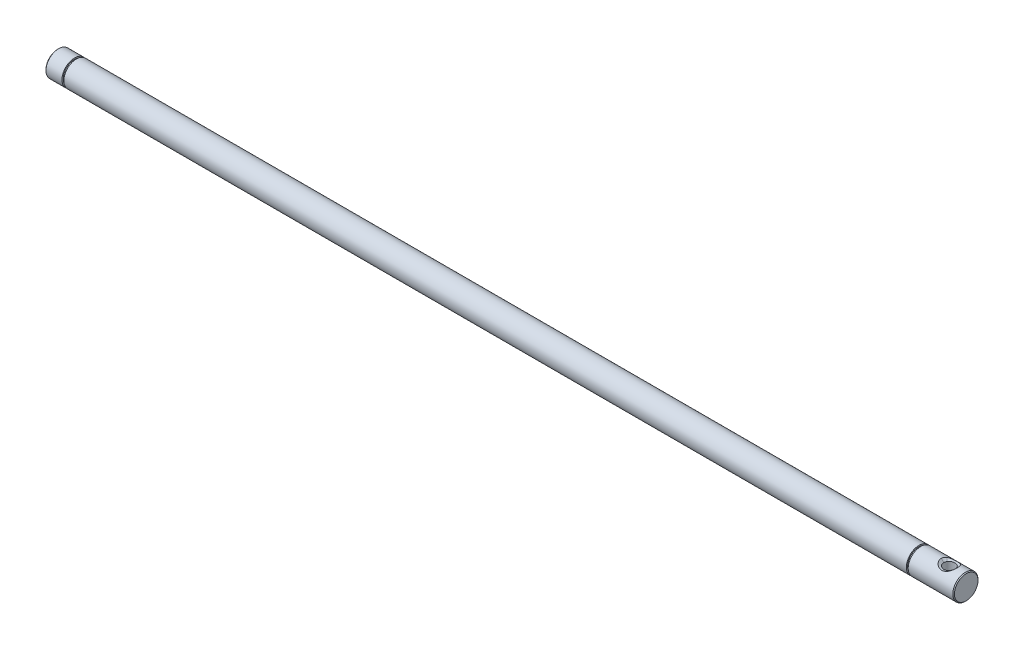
ISO-10303-21;
HEADER;
FILE_DESCRIPTION(('STEP AP214'),'2;1');
FILE_NAME('part.step','',(''),(''),'','','');
FILE_SCHEMA(('AUTOMOTIVE_DESIGN { 1 0 10303 214 1 1 1 1 }'));
ENDSEC;
DATA;
#1=APPLICATION_CONTEXT('core data for automotive mechanical design processes');
#2=APPLICATION_PROTOCOL_DEFINITION('international standard','automotive_design',2000,#1);
#3=PRODUCT_CONTEXT('',#1,'mechanical');
#4=PRODUCT('Part','Part','',(#3));
#5=PRODUCT_RELATED_PRODUCT_CATEGORY('part','',(#4));
#6=PRODUCT_DEFINITION_FORMATION('','',#4);
#7=PRODUCT_DEFINITION_CONTEXT('part definition',#1,'design');
#8=PRODUCT_DEFINITION('design','',#6,#7);
#9=PRODUCT_DEFINITION_SHAPE('','',#8);
#10=(LENGTH_UNIT() NAMED_UNIT(*) SI_UNIT(.MILLI.,.METRE.));
#11=(NAMED_UNIT(*) PLANE_ANGLE_UNIT() SI_UNIT($,.RADIAN.));
#12=(NAMED_UNIT(*) SI_UNIT($,.STERADIAN.) SOLID_ANGLE_UNIT());
#13=UNCERTAINTY_MEASURE_WITH_UNIT(LENGTH_MEASURE(1.E-05),#10,'distance_accuracy_value','');
#14=(GEOMETRIC_REPRESENTATION_CONTEXT(3) GLOBAL_UNCERTAINTY_ASSIGNED_CONTEXT((#13)) GLOBAL_UNIT_ASSIGNED_CONTEXT((#10,
#11,#12)) REPRESENTATION_CONTEXT('',''));
#15=CARTESIAN_POINT('',(0.,0.,0.));
#16=DIRECTION('',(0.,0.,1.));
#17=DIRECTION('',(1.,0.,0.));
#18=AXIS2_PLACEMENT_3D('',#15,#16,#17);
#19=CARTESIAN_POINT('',(-270.,0.,0.));
#20=DIRECTION('',(1.,0.,0.));
#21=DIRECTION('',(0.,0.,-1.));
#22=AXIS2_PLACEMENT_3D('',#19,#20,#21);
#23=PLANE('',#22);
#24=CARTESIAN_POINT('',(-269.999999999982,0.,0.));
#25=DIRECTION('',(1.,0.,0.));
#26=DIRECTION('',(0.,0.,-1.));
#27=AXIS2_PLACEMENT_3D('',#24,#25,#26);
#28=CIRCLE('',#27,6.99999999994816);
#29=CARTESIAN_POINT('',(-269.999999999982,0.,-6.99999999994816));
#30=VERTEX_POINT('',#29);
#31=EDGE_CURVE('E23',#30,#30,#28,.T.);
#32=ORIENTED_EDGE('',*,*,#31,.F.);
#33=EDGE_LOOP('',(#32));
#34=FACE_BOUND('',#33,.T.);
#35=ADVANCED_FACE('F16',(#34),#23,.F.);
#36=CARTESIAN_POINT('',(270.,0.,0.));
#37=DIRECTION('',(1.,0.,0.));
#38=DIRECTION('',(0.,0.,-1.));
#39=AXIS2_PLACEMENT_3D('',#36,#37,#38);
#40=PLANE('',#39);
#41=CARTESIAN_POINT('',(269.999999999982,0.,0.));
#42=DIRECTION('',(-1.,0.,0.));
#43=DIRECTION('',(0.,0.,1.));
#44=AXIS2_PLACEMENT_3D('',#41,#42,#43);
#45=CIRCLE('',#44,6.99999999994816);
#46=CARTESIAN_POINT('',(269.999999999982,0.,6.99999999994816));
#47=VERTEX_POINT('',#46);
#48=EDGE_CURVE('E461',#47,#47,#45,.T.);
#49=ORIENTED_EDGE('',*,*,#48,.F.);
#50=EDGE_LOOP('',(#49));
#51=FACE_BOUND('',#50,.T.);
#52=ADVANCED_FACE('F119',(#51),#40,.T.);
#53=CARTESIAN_POINT('',(260.,-7.6,0.));
#54=DIRECTION('',(0.,-1.,0.));
#55=DIRECTION('',(0.,0.,-1.));
#56=AXIS2_PLACEMENT_3D('',#53,#54,#55);
#57=CYLINDRICAL_SURFACE('',#56,3.3235);
#58=CARTESIAN_POINT('',(257.083354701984,-6.03618781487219,-1.59337141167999));
#59=CARTESIAN_POINT('',(257.061606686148,-6.03681817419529,-1.55356218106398));
#60=CARTESIAN_POINT('',(257.040674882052,-6.03717716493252,-1.51330910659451));
#61=CARTESIAN_POINT('',(257.000476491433,-6.0373799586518,-1.43198070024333));
#62=CARTESIAN_POINT('',(256.981209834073,-6.03722378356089,-1.39090540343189));
#63=CARTESIAN_POINT('',(256.925977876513,-6.03602439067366,-1.26659270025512));
#64=CARTESIAN_POINT('',(256.892552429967,-6.03425104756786,-1.18221691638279));
#65=CARTESIAN_POINT('',(256.832343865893,-6.02926739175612,-1.00997010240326));
#66=CARTESIAN_POINT('',(256.805651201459,-6.02603898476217,-0.922068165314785));
#67=CARTESIAN_POINT('',(256.759631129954,-6.01909052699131,-0.744370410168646));
#68=CARTESIAN_POINT('',(256.740304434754,-6.01537042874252,-0.65457440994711));
#69=CARTESIAN_POINT('',(256.708696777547,-6.00855364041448,-0.471050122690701));
#70=CARTESIAN_POINT('',(256.69663396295,-6.00547790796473,-0.377282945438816));
#71=CARTESIAN_POINT('',(256.684559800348,-6.00227420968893,-0.236099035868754));
#72=CARTESIAN_POINT('',(256.681538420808,-6.00144126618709,-0.188938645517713));
#73=CARTESIAN_POINT('',(256.677508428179,-6.00031248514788,-0.0945225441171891));
#74=CARTESIAN_POINT('',(256.6764999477,-6.0000166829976,-0.047266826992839));
#75=CARTESIAN_POINT('',(256.676500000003,-6.00002280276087,-4.44649383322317E-06));
#76=B_SPLINE_CURVE_WITH_KNOTS('',3,(#58,#59,#60,#61,#62,#63,#64,#65,#66,#67,#68,#69,#70,#71,#72,
#73,#74,#75),.UNSPECIFIED.,.F.,.F.,(4,2,2,2,2,2,2,2,4),(0.,0.136079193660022,0.272152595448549,
0.544123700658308,0.819574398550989,1.09505171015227,1.37843574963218,1.52018893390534,
1.66195145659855),.UNSPECIFIED.);
#77=CARTESIAN_POINT('',(257.083356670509,-6.03618705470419,-1.59337032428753));
#78=VERTEX_POINT('',#77);
#79=CARTESIAN_POINT('',(256.676485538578,-6.00004575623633,-4.44562429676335E-06));
#80=VERTEX_POINT('',#79);
#81=EDGE_CURVE('E80',#78,#80,#76,.T.);
#82=ORIENTED_EDGE('',*,*,#81,.F.);
#83=CARTESIAN_POINT('',(263.32349999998,-6.00000000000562,-1.14586615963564E-05));
#84=CARTESIAN_POINT('',(263.323502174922,-5.9999739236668,-0.0608784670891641));
#85=CARTESIAN_POINT('',(263.321827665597,-6.00047646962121,-0.121743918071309));
#86=CARTESIAN_POINT('',(263.315143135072,-6.00234123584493,-0.243259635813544));
#87=CARTESIAN_POINT('',(263.310134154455,-6.00370318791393,-0.303909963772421));
#88=CARTESIAN_POINT('',(263.296798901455,-6.00708932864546,-0.424818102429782));
#89=CARTESIAN_POINT('',(263.288472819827,-6.009113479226,-0.485075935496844));
#90=CARTESIAN_POINT('',(263.263532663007,-6.01460192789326,-0.635083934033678));
#91=CARTESIAN_POINT('',(263.244856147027,-6.01827979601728,-0.724491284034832));
#92=CARTESIAN_POINT('',(263.200205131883,-6.02524670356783,-0.901483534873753));
#93=CARTESIAN_POINT('',(263.174229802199,-6.02853569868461,-0.989068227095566));
#94=CARTESIAN_POINT('',(263.114624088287,-6.03379663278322,-1.16335556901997));
#95=CARTESIAN_POINT('',(263.080867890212,-6.03574455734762,-1.25001607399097));
#96=CARTESIAN_POINT('',(263.006204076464,-6.03760601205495,-1.42022059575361));
#97=CARTESIAN_POINT('',(262.965296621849,-6.03751958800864,-1.50376468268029));
#98=CARTESIAN_POINT('',(262.876680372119,-6.03509640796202,-1.66702604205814));
#99=CARTESIAN_POINT('',(262.82897863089,-6.03276197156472,-1.74674717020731));
#100=CARTESIAN_POINT('',(262.727137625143,-6.025946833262,-1.90183901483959));
#101=CARTESIAN_POINT('',(262.67299829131,-6.02146610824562,-1.97720968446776));
#102=CARTESIAN_POINT('',(262.504514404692,-6.00556537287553,-2.19215509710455));
#103=CARTESIAN_POINT('',(262.381662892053,-5.99159056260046,-2.32502200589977));
#104=CARTESIAN_POINT('',(262.116286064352,-5.96036404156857,-2.56896045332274));
#105=CARTESIAN_POINT('',(261.973744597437,-5.94310963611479,-2.68001391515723));
#106=CARTESIAN_POINT('',(261.6675991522,-5.90873402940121,-2.88085440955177));
#107=CARTESIAN_POINT('',(261.503462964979,-5.89163519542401,-2.96983723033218));
#108=CARTESIAN_POINT('',(261.162331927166,-5.86174547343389,-3.1191812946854));
#109=CARTESIAN_POINT('',(260.985341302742,-5.84895317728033,-3.1795518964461));
#110=CARTESIAN_POINT('',(260.623530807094,-5.82958804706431,-3.26979997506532));
#111=CARTESIAN_POINT('',(260.438716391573,-5.82301095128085,-3.29969834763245));
#112=CARTESIAN_POINT('',(260.066565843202,-5.81678013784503,-3.32806891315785));
#113=CARTESIAN_POINT('',(259.879229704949,-5.81712643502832,-3.32654103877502));
#114=CARTESIAN_POINT('',(259.511412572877,-5.82461318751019,-3.29246993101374));
#115=CARTESIAN_POINT('',(259.330869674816,-5.83161508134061,-3.26055920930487));
#116=CARTESIAN_POINT('',(258.977774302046,-5.85149083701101,-3.16765390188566));
#117=CARTESIAN_POINT('',(258.805221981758,-5.86436481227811,-3.10665875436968));
#118=CARTESIAN_POINT('',(258.471552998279,-5.89412335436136,-2.95689273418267));
#119=CARTESIAN_POINT('',(258.310527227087,-5.91103602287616,-2.86792579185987));
#120=CARTESIAN_POINT('',(258.005313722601,-5.94548211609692,-2.66466682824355));
#121=CARTESIAN_POINT('',(257.861124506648,-5.96301548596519,-2.55037703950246));
#122=CARTESIAN_POINT('',(257.663259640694,-5.98625560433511,-2.36496001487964));
#123=CARTESIAN_POINT('',(257.60156257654,-5.99336503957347,-2.30236457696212));
#124=CARTESIAN_POINT('',(257.483247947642,-6.00630998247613,-2.17240037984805));
#125=CARTESIAN_POINT('',(257.426629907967,-6.01214560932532,-2.10503206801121));
#126=CARTESIAN_POINT('',(257.318809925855,-6.02215070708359,-1.96586543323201));
#127=CARTESIAN_POINT('',(257.26761372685,-6.02631842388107,-1.89406253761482));
#128=CARTESIAN_POINT('',(257.171032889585,-6.03274522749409,-1.74653597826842));
#129=CARTESIAN_POINT('',(257.125650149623,-6.03500369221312,-1.67081104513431));
#130=CARTESIAN_POINT('',(257.0833547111,-6.03618919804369,-1.59337142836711));
#131=B_SPLINE_CURVE_WITH_KNOTS('',3,(#83,#84,#85,#86,#87,#88,#89,#90,#91,#92,#93,#94,#95,#96,
#97,#98,#99,#100,#101,#102,#103,#104,#105,#106,#107,#108,#109,#110,#111,#112,#113,#114,#115,
#116,#117,#118,#119,#120,#121,#122,#123,#124,#125,#126,#127,#128,#129,#130),.UNSPECIFIED.,.F.,
.F.,(4,2,2,2,2,2,2,2,2,2,2,2,2,2,2,2,2,2,2,2,2,2,2,4),(0.,0.182574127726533,0.365091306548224,
0.547597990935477,0.821503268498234,1.09543972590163,1.37416216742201,1.65287833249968,
1.93130721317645,2.20973909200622,2.75154788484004,3.29380379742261,3.85360212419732,
4.41321723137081,4.97244833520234,5.53168063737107,6.07951967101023,6.62736928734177,
7.17914807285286,7.73087823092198,7.99518202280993,8.25946107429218,8.52401733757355,
8.78865976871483),.UNSPECIFIED.);
#132=CARTESIAN_POINT('',(263.323511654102,-6.00003771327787,-1.14586647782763E-05));
#133=VERTEX_POINT('',#132);
#134=EDGE_CURVE('E391',#133,#78,#131,.T.);
#135=ORIENTED_EDGE('',*,*,#134,.F.);
#136=CARTESIAN_POINT('',(263.32349999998,-6.00001885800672,-1.14597182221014E-05));
#137=CARTESIAN_POINT('',(263.32350028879,-6.00000944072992,0.045310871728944));
#138=CARTESIAN_POINT('',(263.322573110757,-6.00027718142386,0.0906275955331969));
#139=CARTESIAN_POINT('',(263.318867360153,-6.00131198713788,0.181176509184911));
#140=CARTESIAN_POINT('',(263.316088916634,-6.00207901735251,0.226408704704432));
#141=CARTESIAN_POINT('',(263.304984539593,-6.00504589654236,0.361844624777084));
#142=CARTESIAN_POINT('',(263.29388955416,-6.00791160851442,0.451821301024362));
#143=CARTESIAN_POINT('',(263.264193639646,-6.01445653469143,0.631763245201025));
#144=CARTESIAN_POINT('',(263.245491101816,-6.01814644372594,0.721711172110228));
#145=CARTESIAN_POINT('',(263.200704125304,-6.02514292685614,0.899762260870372));
#146=CARTESIAN_POINT('',(263.174619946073,-6.02844951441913,0.987865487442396));
#147=CARTESIAN_POINT('',(263.11436045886,-6.03378359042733,1.16418965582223));
#148=CARTESIAN_POINT('',(263.079971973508,-6.0357710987,1.2523395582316));
#149=CARTESIAN_POINT('',(263.02284371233,-6.03716754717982,1.38213863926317));
#150=CARTESIAN_POINT('',(263.002868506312,-6.0373686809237,1.42501571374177));
#151=CARTESIAN_POINT('',(262.9611065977,-6.03720934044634,1.50987950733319));
#152=CARTESIAN_POINT('',(262.939319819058,-6.03684884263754,1.551866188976));
#153=CARTESIAN_POINT('',(262.91664564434,-6.03619128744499,1.59337077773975));
#154=B_SPLINE_CURVE_WITH_KNOTS('',3,(#136,#137,#138,#139,#140,#141,#142,#143,#144,#145,#146,
#147,#148,#149,#150,#151,#152,#153),.UNSPECIFIED.,.F.,.F.,(4,2,2,2,2,2,2,2,4),(0.,
0.135945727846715,0.271881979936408,0.543653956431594,0.819181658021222,1.09469967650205,
1.37822746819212,1.52009362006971,1.66196573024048),.UNSPECIFIED.);
#155=CARTESIAN_POINT('',(262.91664564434,-6.03619128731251,1.59337077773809));
#156=VERTEX_POINT('',#155);
#157=EDGE_CURVE('E368',#133,#156,#154,.T.);
#158=ORIENTED_EDGE('',*,*,#157,.T.);
#159=CARTESIAN_POINT('',(256.676500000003,-5.99999999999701,-4.44554374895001E-06));
#160=CARTESIAN_POINT('',(256.676497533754,-5.99997383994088,0.0608625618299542));
#161=CARTESIAN_POINT('',(256.678171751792,-6.0004763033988,0.121728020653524));
#162=CARTESIAN_POINT('',(256.684855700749,-6.00234091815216,0.243243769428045));
#163=CARTESIAN_POINT('',(256.689864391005,-6.0037028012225,0.303894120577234));
#164=CARTESIAN_POINT('',(256.703199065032,-6.00708882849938,0.424802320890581));
#165=CARTESIAN_POINT('',(256.711524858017,-6.00911293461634,0.485060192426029));
#166=CARTESIAN_POINT('',(256.736464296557,-6.01460130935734,0.635068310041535));
#167=CARTESIAN_POINT('',(256.755140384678,-6.01827916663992,0.724475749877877));
#168=CARTESIAN_POINT('',(256.799790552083,-6.02524611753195,0.901468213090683));
#169=CARTESIAN_POINT('',(256.825765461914,-6.02853516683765,0.989053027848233));
#170=CARTESIAN_POINT('',(256.885370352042,-6.03379625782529,1.16334068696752));
#171=CARTESIAN_POINT('',(256.919126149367,-6.03574428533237,1.25000138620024));
#172=CARTESIAN_POINT('',(256.993789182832,-6.03760596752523,1.42020632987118));
#173=CARTESIAN_POINT('',(257.034696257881,-6.03751966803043,1.50375064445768));
#174=CARTESIAN_POINT('',(257.123311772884,-6.03509673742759,1.66701248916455));
#175=CARTESIAN_POINT('',(257.171013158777,-6.03276242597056,1.74673387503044));
#176=CARTESIAN_POINT('',(257.272853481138,-6.02594752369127,1.90182626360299));
#177=CARTESIAN_POINT('',(257.326992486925,-6.02146690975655,1.97719721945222));
#178=CARTESIAN_POINT('',(257.495475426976,-6.00556646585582,2.19214348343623));
#179=CARTESIAN_POINT('',(257.618326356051,-5.99159180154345,2.32501099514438));
#180=CARTESIAN_POINT('',(257.883702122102,-5.96036545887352,2.56895072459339));
#181=CARTESIAN_POINT('',(258.026243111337,-5.94311108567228,2.68000486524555));
#182=CARTESIAN_POINT('',(258.332387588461,-5.90873544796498,2.88084672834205));
#183=CARTESIAN_POINT('',(258.496523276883,-5.89163654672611,2.96983025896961));
#184=CARTESIAN_POINT('',(258.837653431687,-5.86174661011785,3.11917583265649));
#185=CARTESIAN_POINT('',(259.014643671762,-5.84895416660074,3.17954723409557));
#186=CARTESIAN_POINT('',(259.376453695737,-5.82958869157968,3.26979702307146));
#187=CARTESIAN_POINT('',(259.561268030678,-5.82301140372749,3.29969628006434));
#188=CARTESIAN_POINT('',(259.933418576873,-5.81678020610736,3.3280686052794));
#189=CARTESIAN_POINT('',(260.120754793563,-5.81712631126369,3.32654160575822));
#190=CARTESIAN_POINT('',(260.488572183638,-5.82461269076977,3.2924721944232));
#191=CARTESIAN_POINT('',(260.66911525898,-5.831614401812,3.26056230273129));
#192=CARTESIAN_POINT('',(261.022211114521,-5.85148984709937,3.16765860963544));
#193=CARTESIAN_POINT('',(261.194763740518,-5.86436369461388,3.10666424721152));
#194=CARTESIAN_POINT('',(261.528433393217,-5.89412198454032,2.95689976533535));
#195=CARTESIAN_POINT('',(261.689459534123,-5.91103452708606,2.86793358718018));
#196=CARTESIAN_POINT('',(261.994673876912,-5.94548071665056,2.66467610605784));
#197=CARTESIAN_POINT('',(262.138863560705,-5.96301430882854,2.55038703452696));
#198=CARTESIAN_POINT('',(262.336730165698,-5.98625622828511,2.36497013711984));
#199=CARTESIAN_POINT('',(262.398428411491,-5.99336652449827,2.3023740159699));
#200=CARTESIAN_POINT('',(262.516745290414,-6.0063129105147,2.17240826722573));
#201=CARTESIAN_POINT('',(262.573364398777,-6.01214911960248,2.10503908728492));
#202=CARTESIAN_POINT('',(262.681186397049,-6.02215383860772,1.96587050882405));
#203=CARTESIAN_POINT('',(262.732383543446,-6.02632059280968,1.89406653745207));
#204=CARTESIAN_POINT('',(262.828966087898,-6.03274622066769,1.74653771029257));
#205=CARTESIAN_POINT('',(262.874349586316,-6.03500447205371,1.67081158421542));
#206=CARTESIAN_POINT('',(262.91664564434,-6.03619128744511,1.59337077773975));
#207=B_SPLINE_CURVE_WITH_KNOTS('',3,(#159,#160,#161,#162,#163,#164,#165,#166,#167,#168,#169,
#170,#171,#172,#173,#174,#175,#176,#177,#178,#179,#180,#181,#182,#183,#184,#185,#186,#187,#188,
#189,#190,#191,#192,#193,#194,#195,#196,#197,#198,#199,#200,#201,#202,#203,#204,#205,#206),
.UNSPECIFIED.,.F.,.F.,(4,2,2,2,2,2,2,2,2,2,2,2,2,2,2,2,2,2,2,2,2,2,2,4),(0.,0.182574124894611,
0.365091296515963,0.547597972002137,0.821503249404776,1.09543970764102,1.37416226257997,
1.65287853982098,1.93130752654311,2.20973951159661,2.75154840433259,3.29380442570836,
3.85360247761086,4.41321730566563,4.97244861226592,5.53168112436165,6.07952022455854,
6.6273698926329,7.1791485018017,7.73087850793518,7.99518643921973,8.25946961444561,
8.52403000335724,8.78867661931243),.UNSPECIFIED.);
#208=EDGE_CURVE('E369',#80,#156,#207,.T.);
#209=ORIENTED_EDGE('',*,*,#208,.F.);
#210=EDGE_LOOP('',(#82,#135,#158,#209));
#211=FACE_BOUND('',#210,.T.);
#212=CARTESIAN_POINT('',(262.91664564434,6.03619128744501,1.59337077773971));
#213=CARTESIAN_POINT('',(262.872812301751,6.03496472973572,1.67362843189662));
#214=CARTESIAN_POINT('',(262.825662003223,6.03258294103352,1.75204310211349));
#215=CARTESIAN_POINT('',(262.725128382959,6.02577724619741,1.90464051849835));
#216=CARTESIAN_POINT('',(262.671747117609,6.0213540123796,1.97882464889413));
#217=CARTESIAN_POINT('',(262.559205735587,6.01074040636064,2.12236313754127));
#218=CARTESIAN_POINT('',(262.500054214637,6.00455263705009,2.19172442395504));
#219=CARTESIAN_POINT('',(262.376346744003,5.9908597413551,2.32527930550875));
#220=CARTESIAN_POINT('',(262.311790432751,5.98335452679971,2.38947255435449));
#221=CARTESIAN_POINT('',(262.110544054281,5.95960731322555,2.57377084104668));
#222=CARTESIAN_POINT('',(261.966260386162,5.94213196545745,2.68561497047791));
#223=CARTESIAN_POINT('',(261.661343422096,5.9080284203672,2.88422341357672));
#224=CARTESIAN_POINT('',(261.50070766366,5.89140035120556,2.97098394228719));
#225=CARTESIAN_POINT('',(261.161982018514,5.86174208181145,3.11939541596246));
#226=CARTESIAN_POINT('',(260.983510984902,5.84883602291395,3.18020681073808));
#227=CARTESIAN_POINT('',(260.618526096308,5.82937328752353,3.27084629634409));
#228=CARTESIAN_POINT('',(260.432012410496,5.82281647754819,3.3006750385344));
#229=CARTESIAN_POINT('',(260.060548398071,5.8167919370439,3.32805101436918));
#230=CARTESIAN_POINT('',(259.875650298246,5.81717522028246,3.32627669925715));
#231=CARTESIAN_POINT('',(259.508870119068,5.82465943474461,3.29216676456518));
#232=CARTESIAN_POINT('',(259.326987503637,5.83175915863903,3.25983663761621));
#233=CARTESIAN_POINT('',(258.972788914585,5.85181067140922,3.16603691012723));
#234=CARTESIAN_POINT('',(258.800409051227,5.86471608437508,3.1047980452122));
#235=CARTESIAN_POINT('',(258.468235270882,5.89447317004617,2.95509512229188));
#236=CARTESIAN_POINT('',(258.308447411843,5.91132672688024,2.866618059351));
#237=CARTESIAN_POINT('',(258.002301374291,5.94591475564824,2.66258140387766));
#238=CARTESIAN_POINT('',(257.85629125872,5.96366025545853,2.54649724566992));
#239=CARTESIAN_POINT('',(257.653342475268,5.98742568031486,2.35531776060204));
#240=CARTESIAN_POINT('',(257.588361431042,5.9948729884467,2.28873694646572));
#241=CARTESIAN_POINT('',(257.464149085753,6.00830945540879,2.15028961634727));
#242=CARTESIAN_POINT('',(257.404915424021,6.01429921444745,2.07842529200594));
#243=CARTESIAN_POINT('',(257.292538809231,6.02436521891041,1.9297684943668));
#244=CARTESIAN_POINT('',(257.239406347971,6.02843820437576,1.85296787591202));
#245=CARTESIAN_POINT('',(257.139757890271,6.03436577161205,1.69510404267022));
#246=CARTESIAN_POINT('',(257.093241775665,6.03622039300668,1.61404090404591));
#247=CARTESIAN_POINT('',(257.007157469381,6.03767494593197,1.44820009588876));
#248=CARTESIAN_POINT('',(256.967595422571,6.03727289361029,1.36341922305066));
#249=CARTESIAN_POINT('',(256.895765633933,6.0345129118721,1.19084612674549));
#250=CARTESIAN_POINT('',(256.863497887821,6.0321549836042,1.10305390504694));
#251=CARTESIAN_POINT('',(256.817513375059,6.02737343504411,0.959539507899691));
#252=CARTESIAN_POINT('',(256.801448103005,6.02532779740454,0.904543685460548));
#253=CARTESIAN_POINT('',(256.772182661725,6.02102942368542,0.793804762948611));
#254=CARTESIAN_POINT('',(256.758982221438,6.01877670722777,0.738061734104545));
#255=CARTESIAN_POINT('',(256.735479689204,6.01434174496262,0.625970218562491));
#256=CARTESIAN_POINT('',(256.72517739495,6.01215949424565,0.569621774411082));
#257=CARTESIAN_POINT('',(256.707506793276,6.00815189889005,0.45652248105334));
#258=CARTESIAN_POINT('',(256.700134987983,6.00632613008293,0.399772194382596));
#259=CARTESIAN_POINT('',(256.688329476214,6.00328823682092,0.28594411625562));
#260=CARTESIAN_POINT('',(256.683896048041,6.00207617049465,0.228866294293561));
#261=CARTESIAN_POINT('',(256.677979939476,6.0004214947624,0.114526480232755));
#262=CARTESIAN_POINT('',(256.676498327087,5.99997916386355,0.0572644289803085));
#263=CARTESIAN_POINT('',(256.6765,6.,0.));
#264=B_SPLINE_CURVE_WITH_KNOTS('',3,(#212,#213,#214,#215,#216,#217,#218,#219,#220,#221,#222,
#223,#224,#225,#226,#227,#228,#229,#230,#231,#232,#233,#234,#235,#236,#237,#238,#239,#240,#241,
#242,#243,#244,#245,#246,#247,#248,#249,#250,#251,#252,#253,#254,#255,#256,#257,#258,#259,#260,
#261,#262,#263),.UNSPECIFIED.,.F.,.F.,(4,2,2,2,2,2,2,2,2,2,2,2,2,2,2,2,2,2,2,2,2,2,2,2,2,4),(0.,
0.274263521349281,0.548436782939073,0.822207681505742,1.0959969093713,1.64349770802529,
2.19108107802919,2.75523955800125,3.31938617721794,3.87143663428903,4.42338787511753,
4.9710063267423,5.51888664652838,6.07815182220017,6.35787462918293,6.63748205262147,
6.91756331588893,7.19763957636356,7.47796209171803,7.75828444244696,7.93020876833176,
8.10211682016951,8.27401286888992,8.44570311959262,8.61740962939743,8.78917825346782),.UNSPECIFIED.);
#265=CARTESIAN_POINT('',(262.916645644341,6.03619128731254,1.59337077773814));
#266=VERTEX_POINT('',#265);
#267=CARTESIAN_POINT('',(256.6765,5.99999999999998,0.));
#268=VERTEX_POINT('',#267);
#269=EDGE_CURVE('E76',#266,#268,#264,.T.);
#270=ORIENTED_EDGE('',*,*,#269,.F.);
#271=CARTESIAN_POINT('',(263.3235,6.,0.));
#272=CARTESIAN_POINT('',(263.323500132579,5.99999525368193,0.0448743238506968));
#273=CARTESIAN_POINT('',(263.322591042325,6.00026182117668,0.0897432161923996));
#274=CARTESIAN_POINT('',(263.318957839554,6.00128353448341,0.179398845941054));
#275=CARTESIAN_POINT('',(263.316233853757,6.00203864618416,0.22418558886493));
#276=CARTESIAN_POINT('',(263.305346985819,6.00495512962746,0.358294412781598));
#277=CARTESIAN_POINT('',(263.294469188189,6.00776772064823,0.447395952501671));
#278=CARTESIAN_POINT('',(263.265138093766,6.01426348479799,0.626926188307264));
#279=CARTESIAN_POINT('',(263.246476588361,6.01796930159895,0.717319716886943));
#280=CARTESIAN_POINT('',(263.201700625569,6.02500943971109,0.896253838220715));
#281=CARTESIAN_POINT('',(263.175586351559,6.02834377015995,0.984794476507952));
#282=CARTESIAN_POINT('',(263.115187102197,6.03373049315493,1.16201371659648));
#283=CARTESIAN_POINT('',(263.080684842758,6.03574239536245,1.25062012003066));
#284=CARTESIAN_POINT('',(263.023330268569,6.03716121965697,1.3810820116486));
#285=CARTESIAN_POINT('',(263.003270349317,6.03736744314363,1.42417636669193));
#286=CARTESIAN_POINT('',(262.961320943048,6.03721290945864,1.50946637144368));
#287=CARTESIAN_POINT('',(262.939431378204,6.03685212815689,1.55166198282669));
#288=CARTESIAN_POINT('',(262.91664564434,6.03619128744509,1.59337077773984));
#289=B_SPLINE_CURVE_WITH_KNOTS('',3,(#271,#272,#273,#274,#275,#276,#277,#278,#279,#280,#281,
#282,#283,#284,#285,#286,#287,#288),.UNSPECIFIED.,.F.,.F.,(4,2,2,2,2,2,2,2,4),(0.,
0.134602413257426,0.269195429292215,0.538289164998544,0.81509627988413,1.09189658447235,
1.37681970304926,1.5193835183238,1.66195340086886),.UNSPECIFIED.);
#290=CARTESIAN_POINT('',(263.3235,6.,0.));
#291=VERTEX_POINT('',#290);
#292=EDGE_CURVE('E89',#291,#266,#289,.T.);
#293=ORIENTED_EDGE('',*,*,#292,.F.);
#294=CARTESIAN_POINT('',(257.083354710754,6.03618922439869,-1.5933714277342));
#295=CARTESIAN_POINT('',(257.127188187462,6.03496384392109,-1.67362927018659));
#296=CARTESIAN_POINT('',(257.174338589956,6.03258171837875,-1.7520440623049));
#297=CARTESIAN_POINT('',(257.274872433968,6.02577462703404,-1.90464169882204));
#298=CARTESIAN_POINT('',(257.328253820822,6.02135033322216,-1.97882592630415));
#299=CARTESIAN_POINT('',(257.440795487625,6.0107361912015,-2.12236461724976));
#300=CARTESIAN_POINT('',(257.499947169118,6.00454894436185,-2.19172601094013));
#301=CARTESIAN_POINT('',(257.62365500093,5.99085725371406,-2.32528109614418));
#302=CARTESIAN_POINT('',(257.688211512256,5.98335272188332,-2.38947444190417));
#303=CARTESIAN_POINT('',(257.889454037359,5.95960741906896,-2.57376888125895));
#304=CARTESIAN_POINT('',(258.033732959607,5.94213274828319,-2.68560971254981));
#305=CARTESIAN_POINT('',(258.338639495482,5.90803029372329,-2.8842132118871));
#306=CARTESIAN_POINT('',(258.499269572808,5.89140263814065,-2.97097209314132));
#307=CARTESIAN_POINT('',(258.837988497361,5.86174435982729,-3.11938442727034));
#308=CARTESIAN_POINT('',(259.016458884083,5.848837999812,-3.18019748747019));
#309=CARTESIAN_POINT('',(259.381442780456,5.82937457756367,-3.27084040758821));
#310=CARTESIAN_POINT('',(259.567956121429,5.82281738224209,-3.30067091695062));
#311=CARTESIAN_POINT('',(259.939419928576,5.81679206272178,-3.32805044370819));
#312=CARTESIAN_POINT('',(260.124318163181,5.81717495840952,-3.32627788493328));
#313=CARTESIAN_POINT('',(260.491098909,5.82465842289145,-3.2921713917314));
#314=CARTESIAN_POINT('',(260.672981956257,5.83175778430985,-3.25984295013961));
#315=CARTESIAN_POINT('',(261.027181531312,5.85180864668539,-3.16604649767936));
#316=CARTESIAN_POINT('',(261.199561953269,5.86471376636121,-3.10480924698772));
#317=CARTESIAN_POINT('',(261.53173709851,5.89447041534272,-2.95510944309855));
#318=CARTESIAN_POINT('',(261.691525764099,5.91132382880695,-2.86663388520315));
#319=CARTESIAN_POINT('',(261.997673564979,5.94591178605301,-2.6626001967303));
#320=CARTESIAN_POINT('',(262.143684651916,5.96365736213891,-2.54651751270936));
#321=CARTESIAN_POINT('',(262.346635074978,5.98742308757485,-2.35534012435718));
#322=CARTESIAN_POINT('',(262.411616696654,5.99487052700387,-2.28875998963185));
#323=CARTESIAN_POINT('',(262.535830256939,6.00830731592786,-2.15031397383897));
#324=CARTESIAN_POINT('',(262.595064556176,6.01429726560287,-2.07845028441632));
#325=CARTESIAN_POINT('',(262.707442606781,6.02436370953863,-1.92979457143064));
#326=CARTESIAN_POINT('',(262.760575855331,6.02843694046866,-1.85299439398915));
#327=CARTESIAN_POINT('',(262.860225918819,6.03436501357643,-1.69513136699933));
#328=CARTESIAN_POINT('',(262.906742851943,6.03621989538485,-1.61406859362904));
#329=CARTESIAN_POINT('',(262.992828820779,6.03767495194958,-1.4482284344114));
#330=CARTESIAN_POINT('',(263.03239171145,6.03727314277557,-1.36344784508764));
#331=CARTESIAN_POINT('',(263.104223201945,6.03451358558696,-1.19087523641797));
#332=CARTESIAN_POINT('',(263.136491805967,6.03215583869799,-1.10308321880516));
#333=CARTESIAN_POINT('',(263.182478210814,6.02737444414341,-0.959567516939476));
#334=CARTESIAN_POINT('',(263.198544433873,6.02532879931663,-0.904570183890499));
#335=CARTESIAN_POINT('',(263.227811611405,6.02103035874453,-0.793828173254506));
#336=CARTESIAN_POINT('',(263.241012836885,6.01877758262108,-0.738083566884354));
#337=CARTESIAN_POINT('',(263.264516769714,6.01434247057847,-0.625988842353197));
#338=CARTESIAN_POINT('',(263.274819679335,6.01216012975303,-0.569638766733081));
#339=CARTESIAN_POINT('',(263.292491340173,6.00815235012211,-0.456536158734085));
#340=CARTESIAN_POINT('',(263.299863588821,6.00632648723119,-0.399784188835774));
#341=CARTESIAN_POINT('',(263.311669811,6.00328842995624,-0.285952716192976));
#342=CARTESIAN_POINT('',(263.316103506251,6.00207629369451,-0.228873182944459));
#343=CARTESIAN_POINT('',(263.322019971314,6.00042152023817,-0.114529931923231));
#344=CARTESIAN_POINT('',(263.323501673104,5.99997916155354,-0.0572661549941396));
#345=CARTESIAN_POINT('',(263.3235,6.,0.));
#346=B_SPLINE_CURVE_WITH_KNOTS('',3,(#294,#295,#296,#297,#298,#299,#300,#301,#302,#303,#304,
#305,#306,#307,#308,#309,#310,#311,#312,#313,#314,#315,#316,#317,#318,#319,#320,#321,#322,#323,
#324,#325,#326,#327,#328,#329,#330,#331,#332,#333,#334,#335,#336,#337,#338,#339,#340,#341,#342,
#343,#344,#345),.UNSPECIFIED.,.F.,.F.,(4,2,2,2,2,2,2,2,2,2,2,2,2,2,2,2,2,2,2,2,2,2,2,2,2,4),(0.,
0.274264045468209,0.548437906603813,0.82220928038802,1.09599895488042,1.64348256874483,
2.19104879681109,2.75520710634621,3.31935358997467,3.8714043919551,4.42335597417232,
4.97097431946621,5.51885452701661,6.07811926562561,6.35784185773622,6.63744906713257,
6.91753061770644,7.19760716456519,7.4779299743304,7.75825262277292,7.93018208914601,
8.10209528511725,8.27399648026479,8.44569190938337,8.61740359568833,8.7891773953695),.UNSPECIFIED.);
#347=CARTESIAN_POINT('',(257.083356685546,6.03618712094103,-1.59337031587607));
#348=VERTEX_POINT('',#347);
#349=EDGE_CURVE('E66',#348,#291,#346,.T.);
#350=ORIENTED_EDGE('',*,*,#349,.F.);
#351=CARTESIAN_POINT('',(256.6765,6.,0.));
#352=CARTESIAN_POINT('',(256.676499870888,5.99999319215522,-0.0449124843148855));
#353=CARTESIAN_POINT('',(256.677410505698,6.00025964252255,-0.0898194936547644));
#354=CARTESIAN_POINT('',(256.68104988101,6.00128294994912,-0.179551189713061));
#355=CARTESIAN_POINT('',(256.68377849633,6.00203977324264,-0.224375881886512));
#356=CARTESIAN_POINT('',(256.694683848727,6.0049610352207,-0.358597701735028));
#357=CARTESIAN_POINT('',(256.705580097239,6.00777633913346,-0.447773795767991));
#358=CARTESIAN_POINT('',(256.734942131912,6.01428882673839,-0.627338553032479));
#359=CARTESIAN_POINT('',(256.753607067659,6.01800805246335,-0.717693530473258));
#360=CARTESIAN_POINT('',(256.798383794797,6.02506778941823,-0.896551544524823));
#361=CARTESIAN_POINT('',(256.82449538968,6.02840831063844,-0.985054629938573));
#362=CARTESIAN_POINT('',(256.884882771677,6.03378101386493,-1.16219778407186));
#363=CARTESIAN_POINT('',(256.919375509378,6.03577195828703,-1.2507657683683));
#364=CARTESIAN_POINT('',(256.976711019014,6.03717051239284,-1.38117172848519));
#365=CARTESIAN_POINT('',(256.99676385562,6.0373718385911,-1.42424784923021));
#366=CARTESIAN_POINT('',(257.038697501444,6.03721093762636,-1.50950193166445));
#367=CARTESIAN_POINT('',(257.0605783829,6.036848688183,-1.55167985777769));
#368=CARTESIAN_POINT('',(257.083354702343,6.03618794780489,-1.59337141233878));
#369=B_SPLINE_CURVE_WITH_KNOTS('',3,(#351,#352,#353,#354,#355,#356,#357,#358,#359,#360,#361,
#362,#363,#364,#365,#366,#367,#368),.UNSPECIFIED.,.F.,.F.,(4,2,2,2,2,2,2,2,4),(0.,
0.134716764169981,0.269424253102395,0.538745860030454,0.815443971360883,1.09213478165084,
1.37693915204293,1.51944445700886,1.6619553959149),.UNSPECIFIED.);
#370=EDGE_CURVE('E72',#268,#348,#369,.T.);
#371=ORIENTED_EDGE('',*,*,#370,.F.);
#372=EDGE_LOOP('',(#270,#293,#350,#371));
#373=FACE_BOUND('',#372,.T.);
#374=ADVANCED_FACE('F74',(#211,#373),#57,.F.);
#375=CARTESIAN_POINT('',(-269.50000000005,0.,0.));
#376=DIRECTION('',(1.,0.,0.));
#377=DIRECTION('',(0.,0.,-1.));
#378=AXIS2_PLACEMENT_3D('',#375,#376,#377);
#379=CONICAL_SURFACE('',#378,7.49999999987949,0.785398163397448);
#380=ORIENTED_EDGE('',*,*,#31,.T.);
#381=EDGE_LOOP('',(#380));
#382=FACE_BOUND('',#381,.T.);
#383=CARTESIAN_POINT('',(-269.5,0.,0.));
#384=DIRECTION('',(1.,0.,0.));
#385=DIRECTION('',(0.,0.,-1.));
#386=AXIS2_PLACEMENT_3D('',#383,#384,#385);
#387=CIRCLE('',#386,7.5);
#388=CARTESIAN_POINT('',(-269.5,0.,-7.5));
#389=VERTEX_POINT('',#388);
#390=EDGE_CURVE('E91',#389,#389,#387,.T.);
#391=ORIENTED_EDGE('',*,*,#390,.F.);
#392=EDGE_LOOP('',(#391));
#393=FACE_BOUND('',#392,.T.);
#394=ADVANCED_FACE('F118',(#382,#393),#379,.T.);
#395=CARTESIAN_POINT('',(255.92882046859,-7.0498823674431,-2.5965488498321));
#396=CARTESIAN_POINT('',(255.940251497,-7.03984580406,-2.58661640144));
#397=CARTESIAN_POINT('',(257.083354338,-6.03618946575,-1.59337156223));
#398=CARTESIAN_POINT('',(257.094899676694,-6.02605253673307,-1.58333978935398));
#399=CARTESIAN_POINT('',(255.94902002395,-7.0389138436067,-2.6261899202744));
#400=CARTESIAN_POINT('',(255.960369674,-7.02898246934,-2.61618111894));
#401=CARTESIAN_POINT('',(257.095334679,-6.03584504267,-1.6153009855));
#402=CARTESIAN_POINT('',(257.106797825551,-6.02581435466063,-1.60519209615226));
#403=CARTESIAN_POINT('',(255.9695029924,-7.0278706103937,-2.6555530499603));
#404=CARTESIAN_POINT('',(255.980770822,-7.01804448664,-2.64547012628));
#405=CARTESIAN_POINT('',(257.107553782,-6.03543211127,-1.63717775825));
#406=CARTESIAN_POINT('',(257.118934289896,-6.02550772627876,-1.6269940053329));
#407=CARTESIAN_POINT('',(255.99026551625,-7.0167587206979,-2.6846361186));
#408=CARTESIAN_POINT('',(256.001451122,-7.00703784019,-2.67448127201));
#409=CARTESIAN_POINT('',(257.120011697,-6.0349497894,-1.65899661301));
#410=CARTESIAN_POINT('',(257.131309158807,-6.02513170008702,-1.6487402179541));
#411=CARTESIAN_POINT('',(256.24993081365,-6.8788361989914,-3.0401153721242));
#412=CARTESIAN_POINT('',(256.260097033,-6.87041341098,-3.02909952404));
#413=CARTESIAN_POINT('',(257.276718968,-6.02813460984,-1.92751471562));
#414=CARTESIAN_POINT('',(257.286986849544,-6.01962759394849,-1.91638870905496));
#415=CARTESIAN_POINT('',(256.55098836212,-6.7322767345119,-3.3523547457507));
#416=CARTESIAN_POINT('',(256.560084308,-6.72513224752,-3.34080170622));
#417=CARTESIAN_POINT('',(257.469678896,-6.01068354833,-2.18549775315));
#418=CARTESIAN_POINT('',(257.478865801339,-6.00346761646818,-2.17382918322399));
#419=CARTESIAN_POINT('',(256.85766680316,-6.5986682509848,-3.6013699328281));
#420=CARTESIAN_POINT('',(256.865784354,-6.59259471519,-3.58953800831));
#421=CARTESIAN_POINT('',(257.677539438,-5.98524113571,-2.4063455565));
#422=CARTESIAN_POINT('',(257.685738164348,-5.97910686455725,-2.39439531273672));
#423=CARTESIAN_POINT('',(257.52474490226,-6.3477611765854,-4.0269062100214));
#424=CARTESIAN_POINT('',(257.530913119,-6.34359024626,-4.01477996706));
#425=CARTESIAN_POINT('',(258.147734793,-5.92649721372,-2.80215567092));
#426=CARTESIAN_POINT('',(258.153964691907,-5.92228457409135,-2.78990816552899));
#427=CARTESIAN_POINT('',(258.27623296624,-6.1554015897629,-4.3051158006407));
#428=CARTESIAN_POINT('',(258.280459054,-6.1525738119,-4.29302521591));
#429=CARTESIAN_POINT('',(258.70306783,-5.86979602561,-3.08396674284));
#430=CARTESIAN_POINT('',(258.707336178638,-5.86693996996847,-3.07175525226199));
#431=CARTESIAN_POINT('',(258.67083273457,-6.0794994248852,-4.4085878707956));
#432=CARTESIAN_POINT('',(258.674076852,-6.07719222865,-4.39654373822));
#433=CARTESIAN_POINT('',(258.998488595,-5.84647260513,-3.19213048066));
#434=CARTESIAN_POINT('',(259.001765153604,-5.84414233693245,-3.17996590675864));
#435=CARTESIAN_POINT('',(259.48022558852,-5.977046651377,-4.5452202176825));
#436=CARTESIAN_POINT('',(259.481484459,-5.97544205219,-4.53325549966));
#437=CARTESIAN_POINT('',(259.607371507,-5.81498213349,-3.33678369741));
#438=CARTESIAN_POINT('',(259.608642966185,-5.81336148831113,-3.32469933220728));
#439=CARTESIAN_POINT('',(260.30829405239,-5.9764510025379,-4.5450017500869));
#440=CARTESIAN_POINT('',(260.307545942,-5.97484994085,-4.53304291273));
#441=CARTESIAN_POINT('',(260.232734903,-5.81474377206,-3.33715917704));
#442=CARTESIAN_POINT('',(260.231979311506,-5.81312669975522,-3.32508075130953));
#443=CARTESIAN_POINT('',(260.719828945,-6.002527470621,-4.5115148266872));
#444=CARTESIAN_POINT('',(260.718081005,-6.00074733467,-4.49952887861));
#445=CARTESIAN_POINT('',(260.543287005,-5.82273373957,-3.30093407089));
#446=CARTESIAN_POINT('',(260.5415215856,-5.82093580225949,-3.28882826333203));
#447=CARTESIAN_POINT('',(261.61417590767,-6.1167227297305,-4.361342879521));
#448=CARTESIAN_POINT('',(261.610239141,-6.11416580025,-4.3492572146));
#449=CARTESIAN_POINT('',(261.216562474,-5.8584728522,-3.1406907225));
#450=CARTESIAN_POINT('',(261.212586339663,-5.8558903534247,-3.12848420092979));
#451=CARTESIAN_POINT('',(262.44231066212,-6.3384744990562,-4.0373753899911));
#452=CARTESIAN_POINT('',(262.436221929,-6.33435893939,-4.02526784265));
#453=CARTESIAN_POINT('',(261.827348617,-5.92280297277,-2.81451310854));
#454=CARTESIAN_POINT('',(261.821198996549,-5.91864625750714,-2.80228448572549));
#455=CARTESIAN_POINT('',(262.86759763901,-6.4864334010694,-3.8049112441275));
#456=CARTESIAN_POINT('',(262.860331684,-6.48125092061,-3.79287358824));
#457=CARTESIAN_POINT('',(262.133736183,-5.96300287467,-2.58910799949));
#458=CARTESIAN_POINT('',(262.12639756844,-5.95776856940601,-2.57694996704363));
#459=CARTESIAN_POINT('',(263.47959300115,-6.7417074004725,-3.3493678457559));
#460=CARTESIAN_POINT('',(263.470424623,-6.73451060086,-3.33775148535));
#461=CARTESIAN_POINT('',(262.553586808,-6.01483063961,-2.17611544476));
#462=CARTESIAN_POINT('',(262.544326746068,-6.00756187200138,-2.16438292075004));
#463=CARTESIAN_POINT('',(263.97723291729,-6.9959946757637,-2.7538189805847));
#464=CARTESIAN_POINT('',(263.966204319,-6.98649568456,-2.74344356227));
#465=CARTESIAN_POINT('',(262.86334449,-6.03659656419,-1.7059017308));
#466=CARTESIAN_POINT('',(262.852205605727,-6.02700258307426,-1.69542255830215));
#467=CARTESIAN_POINT('',(264.14261342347,-7.0863223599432,-2.5167008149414));
#468=CARTESIAN_POINT('',(264.130917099,-7.075958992,-2.50691517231));
#469=CARTESIAN_POINT('',(262.961284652,-6.03962219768,-1.52835090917));
#470=CARTESIAN_POINT('',(262.949471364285,-6.02915519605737,-1.51846741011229));
#471=CARTESIAN_POINT('',(264.48160126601,-7.2814626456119,-1.9248436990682));
#472=CARTESIAN_POINT('',(264.468438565,-7.26913153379,-1.91679385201));
#473=CARTESIAN_POINT('',(263.152168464,-6.0360203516,-1.11180914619));
#474=CARTESIAN_POINT('',(263.13887413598,-6.02356592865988,-1.10367880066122));
#475=CARTESIAN_POINT('',(264.70733979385,-7.426480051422,-1.24763169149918));
#476=CARTESIAN_POINT('',(264.693046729,-7.41252746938,-1.24215148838));
#477=CARTESIAN_POINT('',(263.263740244,-6.01726926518,-0.694131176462));
#478=CARTESIAN_POINT('',(263.249304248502,-6.00317715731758,-0.688596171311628));
#479=CARTESIAN_POINT('',(264.79480602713,-7.4855375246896,-0.83966374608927));
#480=CARTESIAN_POINT('',(264.780040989,-7.47088548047,-0.835912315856));
#481=CARTESIAN_POINT('',(263.303537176,-6.00568105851,-0.460769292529));
#482=CARTESIAN_POINT('',(263.288624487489,-5.9908824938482,-0.456980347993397));
#483=CARTESIAN_POINT('',(264.8385,-7.515,-0.419831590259));
#484=CARTESIAN_POINT('',(264.8235,-7.5,-0.417955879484));
#485=CARTESIAN_POINT('',(263.3235,-6.,-0.230384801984));
#486=CARTESIAN_POINT('',(263.30835,-5.98485,-0.22849033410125));
#487=CARTESIAN_POINT('',(264.8385,-7.515,0.));
#488=CARTESIAN_POINT('',(264.8235,-7.5,0.));
#489=CARTESIAN_POINT('',(263.3235,-6.,0.));
#490=CARTESIAN_POINT('',(263.30835,-5.98485,0.));
#491=B_SPLINE_SURFACE_WITH_KNOTS('',5,1,((#395,#396,#397,#398),(#399,#400,#401,#402),(#403,#404,
#405,#406),(#407,#408,#409,#410),(#411,#412,#413,#414),(#415,#416,#417,#418),(#419,#420,#421,
#422),(#423,#424,#425,#426),(#427,#428,#429,#430),(#431,#432,#433,#434),(#435,#436,#437,#438),
(#439,#440,#441,#442),(#443,#444,#445,#446),(#447,#448,#449,#450),(#451,#452,#453,#454),(#455,
#456,#457,#458),(#459,#460,#461,#462),(#463,#464,#465,#466),(#467,#468,#469,#470),(#471,#472,
#473,#474),(#475,#476,#477,#478),(#479,#480,#481,#482),(#483,#484,#485,#486),(#487,#488,#489,
#490)),.UNSPECIFIED.,.F.,.F.,.F.,(6,3,3,3,3,3,3,6),(2,1,1,2),(11.0198355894,11.2446541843,
13.7946765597,16.3766747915,18.9441491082,22.0681786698,23.8773680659,26.2636008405),
(-0.0171881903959,0.,1.71881903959,1.73617911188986),.UNSPECIFIED.);
#492=CARTESIAN_POINT('',(255.92882158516,-7.04988261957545,-2.59655182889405));
#493=CARTESIAN_POINT('',(255.940252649,-7.03984600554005,-2.58661933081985));
#494=CARTESIAN_POINT('',(257.083359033,-6.036184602,-1.59336952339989));
#495=CARTESIAN_POINT('',(257.09479009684,-6.0261479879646,-1.58343702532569));
#496=B_SPLINE_CURVE_WITH_KNOTS('',1,(#492,#493,#494,#495),.UNSPECIFIED.,.F.,.F.,(2,1,1,2),
(-0.0192498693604,0.,1.92498693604,1.9442368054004),.UNSPECIFIED.);
#497=CARTESIAN_POINT('',(255.940251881,-7.03984553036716,-2.58661744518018));
#498=VERTEX_POINT('',#497);
#499=EDGE_CURVE('E209',#498,#78,#496,.T.);
#500=CARTESIAN_POINT('',(264.8235,-7.5,3.38985177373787E-10));
#501=CARTESIAN_POINT('',(264.823501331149,-7.5000217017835,-0.117526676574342));
#502=CARTESIAN_POINT('',(264.819377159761,-7.49723831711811,-0.235051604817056));
#503=CARTESIAN_POINT('',(264.802885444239,-7.48621759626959,-0.469255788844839));
#504=CARTESIAN_POINT('',(264.790518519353,-7.47798066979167,-0.585935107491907));
#505=CARTESIAN_POINT('',(264.757583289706,-7.45623173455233,-0.817382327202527));
#506=CARTESIAN_POINT('',(264.737032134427,-7.44273075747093,-0.932153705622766));
#507=CARTESIAN_POINT('',(264.687761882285,-7.41075866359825,-1.15922192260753));
#508=CARTESIAN_POINT('',(264.659042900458,-7.3922876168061,-1.27151879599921));
#509=CARTESIAN_POINT('',(264.593473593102,-7.35076458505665,-1.49297243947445));
#510=CARTESIAN_POINT('',(264.556614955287,-7.32770791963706,-1.60212586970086));
#511=CARTESIAN_POINT('',(264.474890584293,-7.27753675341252,-1.81647443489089));
#512=CARTESIAN_POINT('',(264.430021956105,-7.25042078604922,-1.92166812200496));
#513=CARTESIAN_POINT('',(264.33249312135,-7.19276077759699,-2.12734488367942));
#514=CARTESIAN_POINT('',(264.279835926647,-7.1622180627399,-2.22782975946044));
#515=CARTESIAN_POINT('',(264.166949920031,-7.09837020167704,-2.42358103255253));
#516=CARTESIAN_POINT('',(264.106718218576,-7.0650640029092,-2.51884541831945));
#517=CARTESIAN_POINT('',(263.977755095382,-6.99576420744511,-2.70543576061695));
#518=CARTESIAN_POINT('',(263.908879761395,-6.95973063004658,-2.79664735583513));
#519=CARTESIAN_POINT('',(263.763950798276,-6.88637857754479,-2.97269054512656));
#520=CARTESIAN_POINT('',(263.687894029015,-6.84905954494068,-3.05751931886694));
#521=CARTESIAN_POINT('',(263.529038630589,-6.77398596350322,-3.2204286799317));
#522=CARTESIAN_POINT('',(263.446238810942,-6.73623133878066,-3.29850807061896));
#523=CARTESIAN_POINT('',(263.274364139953,-6.66113465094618,-3.44764524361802));
#524=CARTESIAN_POINT('',(263.185288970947,-6.62379260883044,-3.51870267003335));
#525=CARTESIAN_POINT('',(262.996058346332,-6.54823244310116,-3.65749240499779));
#526=CARTESIAN_POINT('',(262.895560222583,-6.51008763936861,-3.72479780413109));
#527=CARTESIAN_POINT('',(262.688753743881,-6.43613000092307,-3.85118060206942));
#528=CARTESIAN_POINT('',(262.582447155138,-6.40031646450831,-3.91026048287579));
#529=CARTESIAN_POINT('',(262.364638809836,-6.33186533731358,-4.02015858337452));
#530=CARTESIAN_POINT('',(262.253136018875,-6.29922838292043,-4.07097514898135));
#531=CARTESIAN_POINT('',(262.025702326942,-6.23791924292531,-4.16431048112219));
#532=CARTESIAN_POINT('',(261.909772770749,-6.20924586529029,-4.20683174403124));
#533=CARTESIAN_POINT('',(261.66927170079,-6.15539919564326,-4.28525613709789));
#534=CARTESIAN_POINT('',(261.54454153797,-6.13042246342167,-4.32080806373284));
#535=CARTESIAN_POINT('',(261.291931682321,-6.08603614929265,-4.38310708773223));
#536=CARTESIAN_POINT('',(261.164051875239,-6.06662676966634,-4.40985386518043));
#537=CARTESIAN_POINT('',(260.905948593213,-6.03377071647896,-4.45470369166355));
#538=CARTESIAN_POINT('',(260.775723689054,-6.02032781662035,-4.47280127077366));
#539=CARTESIAN_POINT('',(260.513881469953,-5.9996776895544,-4.50046277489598));
#540=CARTESIAN_POINT('',(260.382264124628,-5.99247059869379,-4.51002651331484));
#541=CARTESIAN_POINT('',(260.114067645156,-5.98428453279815,-4.5208835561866));
#542=CARTESIAN_POINT('',(259.977470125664,-5.98352250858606,-4.52188877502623));
#543=CARTESIAN_POINT('',(259.704636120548,-5.98880804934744,-4.5148861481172));
#544=CARTESIAN_POINT('',(259.568399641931,-5.99485574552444,-4.50687812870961));
#545=CARTESIAN_POINT('',(259.29728882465,-6.01364710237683,-4.48177356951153));
#546=CARTESIAN_POINT('',(259.162413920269,-6.0263878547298,-4.46468097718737));
#547=CARTESIAN_POINT('',(258.894929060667,-6.05831101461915,-4.42126597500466));
#548=CARTESIAN_POINT('',(258.762319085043,-6.07749336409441,-4.39494364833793));
#549=CARTESIAN_POINT('',(258.498796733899,-6.1221349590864,-4.33254562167));
#550=CARTESIAN_POINT('',(258.367922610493,-6.14766530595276,-4.29635895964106));
#551=CARTESIAN_POINT('',(258.110498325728,-6.20425075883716,-4.21423264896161));
#552=CARTESIAN_POINT('',(257.983948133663,-6.23530582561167,-4.16829306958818));
#553=CARTESIAN_POINT('',(257.736135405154,-6.30211793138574,-4.06657217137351));
#554=CARTESIAN_POINT('',(257.614873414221,-6.33787545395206,-4.01078984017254));
#555=CARTESIAN_POINT('',(257.378572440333,-6.41308563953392,-3.88939947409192));
#556=CARTESIAN_POINT('',(257.263533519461,-6.45253833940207,-3.82379134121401));
#557=CARTESIAN_POINT('',(257.032479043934,-6.53694679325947,-3.67776247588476));
#558=CARTESIAN_POINT('',(256.916991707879,-6.58209421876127,-3.59661460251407));
#559=CARTESIAN_POINT('',(256.695123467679,-6.67381932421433,-3.42341076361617));
#560=CARTESIAN_POINT('',(256.588742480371,-6.72039699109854,-3.33135489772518));
#561=CARTESIAN_POINT('',(256.38556868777,-6.81359755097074,-3.13633338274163));
#562=CARTESIAN_POINT('',(256.2888169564,-6.86021984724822,-3.03332457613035));
#563=CARTESIAN_POINT('',(256.106169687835,-6.95173656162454,-2.81730447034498));
#564=CARTESIAN_POINT('',(256.020279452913,-6.9966301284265,-2.7042883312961));
#565=CARTESIAN_POINT('',(255.940252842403,-7.03984480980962,-2.58661652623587));
#566=B_SPLINE_CURVE_WITH_KNOTS('',3,(#500,#501,#502,#503,#504,#505,#506,#507,#508,#509,#510,
#511,#512,#513,#514,#515,#516,#517,#518,#519,#520,#521,#522,#523,#524,#525,#526,#527,#528,#529,
#530,#531,#532,#533,#534,#535,#536,#537,#538,#539,#540,#541,#542,#543,#544,#545,#546,#547,#548,
#549,#550,#551,#552,#553,#554,#555,#556,#557,#558,#559,#560,#561,#562,#563,#564,#565),
.UNSPECIFIED.,.F.,.F.,(4,2,2,2,2,2,2,2,2,2,2,2,2,2,2,2,2,2,2,2,2,2,2,2,2,2,2,2,2,2,2,2,4),(0.,
0.352472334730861,0.70491819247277,1.05662937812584,1.40833561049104,1.76040268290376,
2.1125972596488,2.46465599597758,2.8168494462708,3.17597208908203,3.5352524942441,
3.89459646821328,4.25395864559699,4.63400856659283,5.0139435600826,5.39395451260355,
5.77385092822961,6.16963712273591,6.5654376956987,6.96148825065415,7.35754746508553,
7.76688769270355,8.17623580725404,8.58540619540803,8.99457289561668,9.4085470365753,
9.82251823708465,10.2365320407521,10.6505499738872,11.0944348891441,11.538315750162,
11.9840154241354,12.4299318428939),.UNSPECIFIED.);
#567=CARTESIAN_POINT('',(264.82350556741,-7.49999430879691,3.38986050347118E-10));
#568=VERTEX_POINT('',#567);
#569=EDGE_CURVE('E94',#568,#498,#566,.T.);
#570=CARTESIAN_POINT('',(264.8235,-7.5,0.));
#571=CARTESIAN_POINT('',(264.761001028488,-7.43750102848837,-8.66150484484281E-07));
#572=CARTESIAN_POINT('',(264.698502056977,-7.37500205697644,-1.68371266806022E-06));
#573=CARTESIAN_POINT('',(264.573504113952,-7.2500041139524,-3.22166044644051E-06));
#574=CARTESIAN_POINT('',(264.51100514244,-7.1875051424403,-3.94204604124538E-06));
#575=CARTESIAN_POINT('',(264.386007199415,-7.06250719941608,-5.28564064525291E-06));
#576=CARTESIAN_POINT('',(264.323508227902,-7.00000822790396,-5.90884965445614E-06));
#577=CARTESIAN_POINT('',(264.198510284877,-6.8750102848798,-7.05809108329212E-06));
#578=CARTESIAN_POINT('',(264.136011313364,-6.81251131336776,-7.58412350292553E-06));
#579=CARTESIAN_POINT('',(264.011013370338,-6.68751337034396,-8.53901175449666E-06));
#580=CARTESIAN_POINT('',(263.948514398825,-6.62501439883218,-8.96786758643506E-06));
#581=CARTESIAN_POINT('',(263.823516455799,-6.50001645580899,-9.72840266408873E-06));
#582=CARTESIAN_POINT('',(263.761017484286,-6.43751748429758,-1.00600819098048E-05));
#583=CARTESIAN_POINT('',(263.636019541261,-6.31251954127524,-1.06262638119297E-05));
#584=CARTESIAN_POINT('',(263.573520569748,-6.25002056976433,-1.08607664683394E-05));
#585=CARTESIAN_POINT('',(263.448522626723,-6.12502262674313,-1.1232595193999E-05));
#586=CARTESIAN_POINT('',(263.38602365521,-6.06252365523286,-1.13699212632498E-05));
#587=CARTESIAN_POINT('',(263.323524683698,-6.00002468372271,-1.14586590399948E-05));
#588=B_SPLINE_CURVE_WITH_KNOTS('',3,(#570,#571,#572,#573,#574,#575,#576,#577,#578,#579,#580,
#581,#582,#583,#584,#585,#586,#587),.UNSPECIFIED.,.F.,.F.,(4,2,2,2,2,2,2,2,4),(0.,
0.265160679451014,0.530321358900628,0.795482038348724,1.06064271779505,1.32580339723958,
1.59096407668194,1.85612475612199,2.12128543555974),.UNSPECIFIED.);
#589=EDGE_CURVE('E260',#568,#133,#588,.T.);
#590=ORIENTED_EDGE('',*,*,#499,.F.);
#591=ORIENTED_EDGE('',*,*,#569,.F.);
#592=ORIENTED_EDGE('',*,*,#589,.T.);
#593=ORIENTED_EDGE('',*,*,#134,.T.);
#594=EDGE_LOOP('',(#590,#591,#592,#593));
#595=FACE_BOUND('',#594,.T.);
#596=ADVANCED_FACE('F225',(#595),#491,.T.);
#597=CARTESIAN_POINT('',(255.161499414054,-7.51497245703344,0.0285389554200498));
#598=CARTESIAN_POINT('',(255.176499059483,-7.4999733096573,0.0284113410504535));
#599=CARTESIAN_POINT('',(256.676463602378,-6.00005857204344,0.0156499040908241));
#600=CARTESIAN_POINT('',(256.691463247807,-5.98505942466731,0.0155222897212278));
#601=CARTESIAN_POINT('',(255.161499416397,-7.51497230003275,0.0228316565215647));
#602=CARTESIAN_POINT('',(255.176499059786,-7.49997315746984,0.0227295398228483));
#603=CARTESIAN_POINT('',(256.676463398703,-6.00005890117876,0.0125178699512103));
#604=CARTESIAN_POINT('',(256.691463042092,-5.98505975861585,0.0124157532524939));
#605=CARTESIAN_POINT('',(255.16149941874,-7.51497214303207,0.0171243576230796));
#606=CARTESIAN_POINT('',(255.17649906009,-7.49997300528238,0.0170477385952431));
#607=CARTESIAN_POINT('',(256.676463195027,-6.00005923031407,0.00938583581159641));
#608=CARTESIAN_POINT('',(256.691462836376,-5.98506009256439,0.00930921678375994));
#609=CARTESIAN_POINT('',(255.161499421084,-7.51497198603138,0.0114170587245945));
#610=CARTESIAN_POINT('',(255.176499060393,-7.49997285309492,0.0113659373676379));
#611=CARTESIAN_POINT('',(256.676462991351,-6.00005955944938,0.00625380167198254));
#612=CARTESIAN_POINT('',(256.691462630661,-5.98506042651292,0.00620268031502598));
#613=CARTESIAN_POINT('',(255.161499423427,-7.51497182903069,0.0057097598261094));
#614=CARTESIAN_POINT('',(255.176499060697,-7.49997270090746,0.00568413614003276));
#615=CARTESIAN_POINT('',(256.676462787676,-6.00005988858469,0.00312176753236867));
#616=CARTESIAN_POINT('',(256.691462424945,-5.98506076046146,0.00309614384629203));
#617=CARTESIAN_POINT('',(255.16149942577,-7.51497167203,2.4609276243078E-06));
#618=CARTESIAN_POINT('',(255.176499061,-7.49997254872,2.33491242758E-06));
#619=CARTESIAN_POINT('',(256.676462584,-6.00006021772,-1.02666072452E-05));
#620=CARTESIAN_POINT('',(256.69146221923,-5.98506109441,-1.03926224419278E-05));
#621=CARTESIAN_POINT('',(255.16149952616,-7.5149649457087,-0.24451319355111));
#622=CARTESIAN_POINT('',(255.176499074,-7.49996602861,-0.243420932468));
#623=CARTESIAN_POINT('',(256.676453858,-6.00007431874,-0.134194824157));
#624=CARTESIAN_POINT('',(256.69145340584,-5.9850754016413,-0.13310256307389));
#625=CARTESIAN_POINT('',(255.17632150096,-7.5049749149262,-0.48902537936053));
#626=CARTESIAN_POINT('',(255.191241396,-7.49009390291,-0.486840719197));
#627=CARTESIAN_POINT('',(256.6832309,-6.00199270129,-0.268374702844));
#628=CARTESIAN_POINT('',(256.69815079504,-5.9871116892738,-0.26619004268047));
#629=CARTESIAN_POINT('',(255.20596427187,-7.4850114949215,-0.73123562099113));
#630=CARTESIAN_POINT('',(255.220725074,-7.47036579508,-0.727986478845));
#631=CARTESIAN_POINT('',(256.696805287,-6.00579581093,-0.403072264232));
#632=CARTESIAN_POINT('',(256.71156608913,-5.9911501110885,-0.39982312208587));
#633=CARTESIAN_POINT('',(255.28778290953,-7.4306752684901,-1.17132955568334));
#634=CARTESIAN_POINT('',(255.302113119,-7.41666116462,-1.16621230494));
#635=CARTESIAN_POINT('',(256.735134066,-6.01525077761,-0.654487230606));
#636=CARTESIAN_POINT('',(256.74946427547,-6.0012366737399,-0.64936997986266));
#637=CARTESIAN_POINT('',(255.41750654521,-7.3480200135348,-1.58955939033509));
#638=CARTESIAN_POINT('',(255.431192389,-7.33492793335,-1.58282137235));
#639=CARTESIAN_POINT('',(256.799776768,-6.02571991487,-0.909019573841));
#640=CARTESIAN_POINT('',(256.81346261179,-6.0126278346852,-0.90228155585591));
#641=CARTESIAN_POINT('',(255.48749684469,-7.3043488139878,-1.7775407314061));
#642=CARTESIAN_POINT('',(255.500845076,-7.29173351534,-1.77011511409));
#643=CARTESIAN_POINT('',(256.835668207,-6.03020365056,-1.02755338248));
#644=CARTESIAN_POINT('',(256.84901643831,-6.0175883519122,-1.0201277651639));
#645=CARTESIAN_POINT('',(255.61092780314,-7.2294506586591,-2.0595250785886));
#646=CARTESIAN_POINT('',(255.623703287,-7.21763023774,-2.05113584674));
#647=CARTESIAN_POINT('',(256.901251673,-6.03558814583,-1.21221266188));
#648=CARTESIAN_POINT('',(256.91402715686,-6.0237677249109,-1.2038234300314));
#649=CARTESIAN_POINT('',(255.75586525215,-7.145797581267,-2.32415494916));
#650=CARTESIAN_POINT('',(255.768010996,-7.13482422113,-2.31496529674));
#651=CARTESIAN_POINT('',(256.982585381,-6.03748820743,-1.39600005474));
#652=CARTESIAN_POINT('',(256.99473112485,-6.026514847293,-1.38681040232));
#653=CARTESIAN_POINT('',(255.81093913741,-7.1145935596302,-2.4173997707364));
#654=CARTESIAN_POINT('',(255.822851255,-7.10393067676,-2.40794214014));
#655=CARTESIAN_POINT('',(257.014063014,-6.03764238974,-1.4621790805));
#656=CARTESIAN_POINT('',(257.02597513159,-6.0269795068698,-1.4527214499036));
#657=CARTESIAN_POINT('',(255.86862417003,-7.0825691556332,-2.5082148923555));
#658=CARTESIAN_POINT('',(255.880297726,-7.07221911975,-2.49850992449));
#659=CARTESIAN_POINT('',(257.047653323,-6.03721553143,-1.52801313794));
#660=CARTESIAN_POINT('',(257.05932687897,-6.0268654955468,-1.5183081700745));
#661=CARTESIAN_POINT('',(255.92882158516,-7.0498826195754,-2.5965518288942));
#662=CARTESIAN_POINT('',(255.940252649,-7.03984600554,-2.58661933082));
#663=CARTESIAN_POINT('',(257.083359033,-6.036184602,-1.5933695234));
#664=CARTESIAN_POINT('',(257.09479009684,-6.0261479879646,-1.5834370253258));
#665=B_SPLINE_SURFACE_WITH_KNOTS('',5,1,((#597,#598,#599,#600),(#601,#602,#603,#604),(#605,#606,
#607,#608),(#609,#610,#611,#612),(#613,#614,#615,#616),(#617,#618,#619,#620),(#621,#622,#623,
#624),(#625,#626,#627,#628),(#629,#630,#631,#632),(#633,#634,#635,#636),(#637,#638,#639,#640),
(#641,#642,#643,#644),(#645,#646,#647,#648),(#649,#650,#651,#652),(#653,#654,#655,#656),(#657,
#658,#659,#660),(#661,#662,#663,#664)),.UNSPECIFIED.,.F.,.F.,.F.,(6,5,3,3,6),(2,1,1,2),
(15.213523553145,15.2459660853,16.6358892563,17.8202843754,18.4902193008),(-0.0192498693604,0.,
1.92498693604,1.9442368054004),.UNSPECIFIED.);
#666=CARTESIAN_POINT('',(255.1615,-7.515,0.));
#667=CARTESIAN_POINT('',(255.1765,-7.5,0.));
#668=CARTESIAN_POINT('',(256.6765,-6.,0.));
#669=CARTESIAN_POINT('',(256.69165,-5.98485,0.));
#670=B_SPLINE_CURVE_WITH_KNOTS('',1,(#666,#667,#668,#669),.UNSPECIFIED.,.F.,.F.,(2,1,1,2),
(-0.0167739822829,0.,1.67739822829,1.69433995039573),.UNSPECIFIED.);
#671=CARTESIAN_POINT('',(255.176492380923,-7.49999311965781,2.63940554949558E-06));
#672=VERTEX_POINT('',#671);
#673=EDGE_CURVE('E271',#672,#80,#670,.T.);
#674=CARTESIAN_POINT('',(255.940253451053,-7.03984494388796,-2.58661616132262));
#675=CARTESIAN_POINT('',(255.876361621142,-7.07434946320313,-2.49275234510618));
#676=CARTESIAN_POINT('',(255.816200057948,-7.10777408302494,-2.39593954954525));
#677=CARTESIAN_POINT('',(255.703633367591,-7.17173798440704,-2.19704805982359));
#678=CARTESIAN_POINT('',(255.651225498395,-7.20227828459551,-2.09497124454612));
#679=CARTESIAN_POINT('',(255.555128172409,-7.25935076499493,-1.88765192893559));
#680=CARTESIAN_POINT('',(255.511321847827,-7.28593527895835,-1.78247804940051));
#681=CARTESIAN_POINT('',(255.431623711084,-7.33503733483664,-1.56821737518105));
#682=CARTESIAN_POINT('',(255.395734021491,-7.35755378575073,-1.45912954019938));
#683=CARTESIAN_POINT('',(255.332779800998,-7.39752824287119,-1.24041884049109));
#684=CARTESIAN_POINT('',(255.305526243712,-7.41509350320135,-1.13086995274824));
#685=CARTESIAN_POINT('',(255.258745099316,-7.44549656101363,-0.909439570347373));
#686=CARTESIAN_POINT('',(255.239220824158,-7.45833233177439,-0.797557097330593));
#687=CARTESIAN_POINT('',(255.207880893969,-7.47903492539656,-0.571771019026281));
#688=CARTESIAN_POINT('',(255.196098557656,-7.48688026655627,-0.457860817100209));
#689=CARTESIAN_POINT('',(255.180392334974,-7.49737179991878,-0.229299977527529));
#690=CARTESIAN_POINT('',(255.176465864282,-7.50001970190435,-0.114649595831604));
#691=CARTESIAN_POINT('',(255.176471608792,-7.49999999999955,2.63997060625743E-06));
#692=B_SPLINE_CURVE_WITH_KNOTS('',3,(#674,#675,#676,#677,#678,#679,#680,#681,#682,#683,#684,
#685,#686,#687,#688,#689,#690,#691),.UNSPECIFIED.,.F.,.F.,(4,2,2,2,2,2,2,2,4),(0.,
0.355934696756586,0.711743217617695,1.06231976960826,1.41299020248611,1.75534831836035,
2.09785297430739,2.44182216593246,2.78567818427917),.UNSPECIFIED.);
#693=EDGE_CURVE('E362',#498,#672,#692,.T.);
#694=ORIENTED_EDGE('',*,*,#673,.F.);
#695=ORIENTED_EDGE('',*,*,#693,.F.);
#696=ORIENTED_EDGE('',*,*,#499,.T.);
#697=ORIENTED_EDGE('',*,*,#81,.T.);
#698=EDGE_LOOP('',(#694,#695,#696,#697));
#699=FACE_BOUND('',#698,.T.);
#700=ADVANCED_FACE('F170',(#699),#665,.T.);
#701=CARTESIAN_POINT('',(255.92882173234,7.0498825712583,-2.5965519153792));
#702=CARTESIAN_POINT('',(255.940252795,7.0398459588,-2.58661941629));
#703=CARTESIAN_POINT('',(257.083359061,6.03618471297,-1.59336950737));
#704=CARTESIAN_POINT('',(257.094904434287,6.02604773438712,-1.58333768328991));
#705=CARTESIAN_POINT('',(255.8686242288,7.0825691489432,-2.5082148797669));
#706=CARTESIAN_POINT('',(255.880297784,7.07221911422,-2.49850991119));
#707=CARTESIAN_POINT('',(257.047653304,6.0372156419,-1.5280130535));
#708=CARTESIAN_POINT('',(257.059443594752,6.02676210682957,-1.51821103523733));
#709=CARTESIAN_POINT('',(255.81093911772,7.1145935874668,-2.4173996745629));
#710=CARTESIAN_POINT('',(255.822851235,7.10393070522,-2.40794204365));
#711=CARTESIAN_POINT('',(257.014062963,6.03764248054,-1.46217895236));
#712=CARTESIAN_POINT('',(257.026094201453,6.02687296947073,-1.45262674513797));
#713=CARTESIAN_POINT('',(255.75586519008,7.1457976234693,-2.3241548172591));
#714=CARTESIAN_POINT('',(255.768010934,7.1348242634,-2.31496516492));
#715=CARTESIAN_POINT('',(256.982585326,6.03748825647,-1.39599993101));
#716=CARTESIAN_POINT('',(256.994852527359,6.02640516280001,-1.38671838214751));
#717=CARTESIAN_POINT('',(255.61092769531,7.2294507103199,-2.0595248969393));
#718=CARTESIAN_POINT('',(255.62370318,7.21763028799,-2.05113566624));
#719=CARTESIAN_POINT('',(256.901251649,6.035588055,-1.21221259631));
#720=CARTESIAN_POINT('',(256.914154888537,6.0236494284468,-1.20373947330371));
#721=CARTESIAN_POINT('',(255.48749696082,7.3043487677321,-1.7775408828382));
#722=CARTESIAN_POINT('',(255.500845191,7.2917334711,-1.77011526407));
#723=CARTESIAN_POINT('',(256.835668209,6.03020380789,-1.02755338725));
#724=CARTESIAN_POINT('',(256.849149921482,6.01746235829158,-1.02005351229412));
#725=CARTESIAN_POINT('',(255.41750662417,7.3480199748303,-1.58955962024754));
#726=CARTESIAN_POINT('',(255.431192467,7.33492789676,-1.58282159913));
#727=CARTESIAN_POINT('',(256.79977675,6.02572008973,-0.909019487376));
#728=CARTESIAN_POINT('',(256.813599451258,6.012497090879,-0.902214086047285));
#729=CARTESIAN_POINT('',(255.28778683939,7.4306727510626,-1.17134225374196));
#730=CARTESIAN_POINT('',(255.30211703,7.4166586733,-1.16622495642));
#731=CARTESIAN_POINT('',(256.735136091,6.01525089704,-0.654495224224));
#732=CARTESIAN_POINT('',(256.749609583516,6.00109667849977,-0.64932675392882));
#733=CARTESIAN_POINT('',(255.20596945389,7.4850080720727,-0.73126322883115));
#734=CARTESIAN_POINT('',(255.220730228,7.47036241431,-0.728013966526));
#735=CARTESIAN_POINT('',(256.696807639,6.00579663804,-0.403087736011));
#736=CARTESIAN_POINT('',(256.711716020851,5.99100452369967,-0.399805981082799));
#737=CARTESIAN_POINT('',(255.17632271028,7.5050051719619,-0.48905570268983));
#738=CARTESIAN_POINT('',(255.191243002,7.49012321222,-0.486870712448));
#739=CARTESIAN_POINT('',(256.683272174,6.00192723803,-0.268371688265));
#740=CARTESIAN_POINT('',(256.698341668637,5.98689645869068,-0.266164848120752));
#741=CARTESIAN_POINT('',(255.1615,7.515,-0.24452775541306));
#742=CARTESIAN_POINT('',(255.1765,7.5,-0.243435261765));
#743=CARTESIAN_POINT('',(256.6765,6.,-0.134185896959));
#744=CARTESIAN_POINT('',(256.69165,5.98485,-0.133082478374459));
#745=CARTESIAN_POINT('',(255.1615,7.515,0.));
#746=CARTESIAN_POINT('',(255.1765,7.5,0.));
#747=CARTESIAN_POINT('',(256.6765,6.,0.));
#748=CARTESIAN_POINT('',(256.69165,5.98485,0.));
#749=B_SPLINE_SURFACE_WITH_KNOTS('',5,1,((#701,#702,#703,#704),(#705,#706,#707,#708),(#709,#710,
#711,#712),(#713,#714,#715,#716),(#717,#718,#719,#720),(#721,#722,#723,#724),(#725,#726,#727,
#728),(#729,#730,#731,#732),(#733,#734,#735,#736),(#737,#738,#739,#740),(#741,#742,#743,#744),
(#745,#746,#747,#748)),.UNSPECIFIED.,.F.,.F.,.F.,(6,3,3,6),(2,1,1,2),(15.2464556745,
15.9163899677,17.1007850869,18.4906284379),(-0.0193365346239,0.,1.93365346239,1.95318336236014),.UNSPECIFIED.);
#750=DIRECTION('',(-0.707106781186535,0.70710678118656,0.));
#751=VECTOR('',#750,1.);
#752=CARTESIAN_POINT('',(255.9265,6.75,0.));
#753=LINE('',#752,#751);
#754=CARTESIAN_POINT('',(255.1765,7.49999999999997,0.));
#755=VERTEX_POINT('',#754);
#756=EDGE_CURVE('E83',#268,#755,#753,.T.);
#757=CARTESIAN_POINT('',(255.92882049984,7.0498823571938,-2.5965488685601));
#758=CARTESIAN_POINT('',(255.940251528,7.03984579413,-2.58661641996));
#759=CARTESIAN_POINT('',(257.083354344,6.03618948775,-1.59337155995));
#760=CARTESIAN_POINT('',(257.094899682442,6.02605255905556,-1.5833397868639));
#761=B_SPLINE_CURVE_WITH_KNOTS('',1,(#757,#758,#759,#760),.UNSPECIFIED.,.F.,.F.,(2,1,1,2),
(-0.0169114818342,0.,1.69114818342,1.70822878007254),.UNSPECIFIED.);
#762=CARTESIAN_POINT('',(255.940251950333,7.03984550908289,-2.58661748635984));
#763=VERTEX_POINT('',#762);
#764=EDGE_CURVE('E79',#763,#348,#761,.T.);
#765=CARTESIAN_POINT('',(255.1765,7.5,0.));
#766=CARTESIAN_POINT('',(255.17649839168,7.5000218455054,-0.117654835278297));
#767=CARTESIAN_POINT('',(255.180631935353,7.49723230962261,-0.235308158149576));
#768=CARTESIAN_POINT('',(255.197164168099,7.48618510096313,-0.469817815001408));
#769=CARTESIAN_POINT('',(255.209565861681,7.47792544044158,-0.586673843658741));
#770=CARTESIAN_POINT('',(255.24255225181,7.45614364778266,-0.818167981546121));
#771=CARTESIAN_POINT('',(255.263098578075,7.4426461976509,-0.932813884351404));
#772=CARTESIAN_POINT('',(255.312330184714,7.41069920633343,-1.15958433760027));
#773=CARTESIAN_POINT('',(255.341011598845,7.39225201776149,-1.27171005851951));
#774=CARTESIAN_POINT('',(255.405397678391,7.35148250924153,-1.48914219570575));
#775=CARTESIAN_POINT('',(255.440845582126,7.32930459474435,-1.59455189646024));
#776=CARTESIAN_POINT('',(255.519167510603,7.28116509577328,-1.8016482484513));
#777=CARTESIAN_POINT('',(255.562039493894,7.25520455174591,-1.90333591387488));
#778=CARTESIAN_POINT('',(255.65631671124,7.19930290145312,-2.10505792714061));
#779=CARTESIAN_POINT('',(255.707919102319,7.16927407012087,-2.20497577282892));
#780=CARTESIAN_POINT('',(255.818569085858,7.10645814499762,-2.39974677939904));
#781=CARTESIAN_POINT('',(255.877619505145,7.07367000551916,-2.49459799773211));
#782=CARTESIAN_POINT('',(255.940253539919,7.03984493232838,-2.58661619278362));
#783=B_SPLINE_CURVE_WITH_KNOTS('',3,(#765,#766,#767,#768,#769,#770,#771,#772,#773,#774,#775,
#776,#777,#778,#779,#780,#781,#782),.UNSPECIFIED.,.F.,.F.,(4,2,2,2,2,2,2,2,4),(0.,
0.352856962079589,0.705842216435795,1.05718391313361,1.40835891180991,1.74819144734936,
2.08793068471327,2.43673455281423,2.78567120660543),.UNSPECIFIED.);
#784=EDGE_CURVE('E86',#755,#763,#783,.T.);
#785=ORIENTED_EDGE('',*,*,#756,.F.);
#786=ORIENTED_EDGE('',*,*,#370,.T.);
#787=ORIENTED_EDGE('',*,*,#764,.F.);
#788=ORIENTED_EDGE('',*,*,#784,.F.);
#789=EDGE_LOOP('',(#785,#786,#787,#788));
#790=FACE_BOUND('',#789,.T.);
#791=ADVANCED_FACE('F84',(#790),#749,.T.);
#792=CARTESIAN_POINT('',(264.8385,7.515,0.));
#793=CARTESIAN_POINT('',(264.8235,7.5,0.));
#794=CARTESIAN_POINT('',(263.3235,6.,0.));
#795=CARTESIAN_POINT('',(263.30835,5.98485,0.));
#796=CARTESIAN_POINT('',(264.8385,7.515,-0.41983156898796));
#797=CARTESIAN_POINT('',(264.8235,7.5,-0.417955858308));
#798=CARTESIAN_POINT('',(263.3235,6.,-0.230384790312));
#799=CARTESIAN_POINT('',(263.30835,5.98485,-0.22849032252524));
#800=CARTESIAN_POINT('',(264.79480603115,7.4855375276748,-0.83966257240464));
#801=CARTESIAN_POINT('',(264.780040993,7.47088548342,-0.835911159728));
#802=CARTESIAN_POINT('',(263.303537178,6.00568105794,-0.460769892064));
#803=CARTESIAN_POINT('',(263.288624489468,5.99088249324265,-0.456980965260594));
#804=CARTESIAN_POINT('',(264.70734024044,7.4264802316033,-1.24763106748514));
#805=CARTESIAN_POINT('',(264.693047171,7.41252764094,-1.24215087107));
#806=CARTESIAN_POINT('',(263.263740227,6.01726857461,-0.694131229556));
#807=CARTESIAN_POINT('',(263.249304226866,6.00317645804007,-0.688596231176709));
#808=CARTESIAN_POINT('',(264.48160077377,7.2814624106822,-1.9248446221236));
#809=CARTESIAN_POINT('',(264.468438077,7.26913130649,-1.91679476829));
#810=CARTESIAN_POINT('',(263.1521684,6.03602088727,-1.11180938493));
#811=CARTESIAN_POINT('',(263.138874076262,6.02356647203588,-1.10367903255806));
#812=CARTESIAN_POINT('',(264.14261328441,7.0863222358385,-2.5167011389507));
#813=CARTESIAN_POINT('',(264.130916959,7.07595886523,-2.50691549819));
#814=CARTESIAN_POINT('',(262.961284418,6.03962180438,-1.52835142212));
#815=CARTESIAN_POINT('',(262.949471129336,6.02915480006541,-1.51846792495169));
#816=CARTESIAN_POINT('',(263.97723367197,6.9959950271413,-2.7538181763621));
#817=CARTESIAN_POINT('',(263.96620507,6.98649603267,-2.74344276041));
#818=CARTESIAN_POINT('',(262.863344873,6.03659658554,-1.7059011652));
#819=CARTESIAN_POINT('',(262.85220598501,6.02700260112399,-1.69542199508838));
#820=CARTESIAN_POINT('',(263.47959295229,6.7417074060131,-3.3493678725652));
#821=CARTESIAN_POINT('',(263.470424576,6.73451060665,-3.33775151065));
#822=CARTESIAN_POINT('',(262.553586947,6.01483067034,-2.17611531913));
#823=CARTESIAN_POINT('',(262.544326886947,6.00756190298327,-2.16438279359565));
#824=CARTESIAN_POINT('',(262.86759856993,6.4864337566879,-3.8049105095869));
#825=CARTESIAN_POINT('',(262.860332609,6.48125127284,-3.79287285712));
#826=CARTESIAN_POINT('',(262.133736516,5.96300288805,-2.58910761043));
#827=CARTESIAN_POINT('',(262.126397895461,5.95776857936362,-2.57694958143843));
#828=CARTESIAN_POINT('',(262.44231141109,6.3384745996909,-4.0373752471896));
#829=CARTESIAN_POINT('',(262.43622267,6.33435904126,-4.02526770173));
#830=CARTESIAN_POINT('',(261.827348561,5.92280319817,-2.81451315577));
#831=CARTESIAN_POINT('',(261.821198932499,5.91864648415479,-2.8022845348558));
#832=CARTESIAN_POINT('',(261.6141750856,6.1167226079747,-4.361343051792));
#833=CARTESIAN_POINT('',(261.610238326,6.11416567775,-4.34925738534));
#834=CARTESIAN_POINT('',(261.216562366,5.85847265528,-3.14069074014));
#835=CARTESIAN_POINT('',(261.212586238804,5.85589015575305,-3.12848421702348));
#836=CARTESIAN_POINT('',(260.71982978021,6.0025276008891,-4.5115146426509));
#837=CARTESIAN_POINT('',(260.718081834,6.00074746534,-4.49952869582));
#838=CARTESIAN_POINT('',(260.543287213,5.82273391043,-3.30093401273));
#839=CARTESIAN_POINT('',(260.541521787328,5.82093597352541,-3.28882820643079));
#840=CARTESIAN_POINT('',(260.30829459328,5.9764509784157,-4.5450017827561));
#841=CARTESIAN_POINT('',(260.307546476,5.97484991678,-4.53304294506));
#842=CARTESIAN_POINT('',(260.232734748,5.81474375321,-3.33715917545));
#843=CARTESIAN_POINT('',(260.231979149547,5.81312668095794,-3.32508074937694));
#844=CARTESIAN_POINT('',(259.48022455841,5.9770466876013,-4.5452201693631));
#845=CARTESIAN_POINT('',(259.481483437,5.97544208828,-4.53325545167));
#846=CARTESIAN_POINT('',(259.607371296,5.81498215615,-3.33678368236));
#847=CARTESIAN_POINT('',(259.608642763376,5.81336151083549,-3.32469931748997));
#848=CARTESIAN_POINT('',(258.67083307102,6.0794994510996,-4.4085878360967));
#849=CARTESIAN_POINT('',(258.674077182,6.07719225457,-4.39654370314));
#850=CARTESIAN_POINT('',(258.99848828,5.84647260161,-3.19213040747));
#851=CARTESIAN_POINT('',(259.00176483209,5.84414233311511,-3.17996583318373));
#852=CARTESIAN_POINT('',(258.27623386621,6.1554013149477,-4.3051162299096));
#853=CARTESIAN_POINT('',(258.280459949,6.15257353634,-4.29302564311));
#854=CARTESIAN_POINT('',(258.703068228,5.86979567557,-3.08396696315));
#855=CARTESIAN_POINT('',(258.707336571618,5.86693961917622,-3.0717554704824));
#856=CARTESIAN_POINT('',(257.5247446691,6.3477612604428,-4.0269060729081));
#857=CARTESIAN_POINT('',(257.530912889,6.3435903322,-4.01477983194));
#858=CARTESIAN_POINT('',(258.147734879,5.92649750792,-2.80215573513));
#859=CARTESIAN_POINT('',(258.153964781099,5.92228487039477,-2.78990823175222));
#860=CARTESIAN_POINT('',(256.85766752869,6.5986679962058,-3.6013703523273));
#861=CARTESIAN_POINT('',(256.865785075,6.59259445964,-3.58953842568));
#862=CARTESIAN_POINT('',(257.677539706,5.98524080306,-2.40634576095));
#863=CARTESIAN_POINT('',(257.685738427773,5.97910653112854,-2.39439551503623));
#864=CARTESIAN_POINT('',(256.55098872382,6.7322766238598,-3.352355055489));
#865=CARTESIAN_POINT('',(256.560084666,6.7251321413,-3.34080201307));
#866=CARTESIAN_POINT('',(257.469678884,6.01068388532,-2.18549777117));
#867=CARTESIAN_POINT('',(257.478865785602,6.0034679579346,-2.17382919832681));
#868=CARTESIAN_POINT('',(256.24993069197,6.8788362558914,-3.040115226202));
#869=CARTESIAN_POINT('',(256.260096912,6.87041346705,-3.02909937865));
#870=CARTESIAN_POINT('',(257.276718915,6.02813458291,-1.92751462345));
#871=CARTESIAN_POINT('',(257.28698679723,6.01962756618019,-1.91638861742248));
#872=CARTESIAN_POINT('',(255.9902655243,7.0167587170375,-2.6846361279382));
#873=CARTESIAN_POINT('',(256.00145113,7.00703783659,-2.67448128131));
#874=CARTESIAN_POINT('',(257.1200117,6.03494979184,-1.65899661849));
#875=CARTESIAN_POINT('',(257.131309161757,6.02513170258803,-1.64874022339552));
#876=CARTESIAN_POINT('',(255.96950300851,7.0278706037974,-2.6555530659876));
#877=CARTESIAN_POINT('',(255.980770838,7.01804448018,-2.64547014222));
#878=CARTESIAN_POINT('',(257.107553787,6.03543211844,-1.63717776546));
#879=CARTESIAN_POINT('',(257.118934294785,6.02550773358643,-1.62699401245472));
#880=CARTESIAN_POINT('',(255.94902004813,7.0389138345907,-2.6261899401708));
#881=CARTESIAN_POINT('',(255.960369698,7.02898246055,-2.61618113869));
#882=CARTESIAN_POINT('',(257.095334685,6.03584505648,-1.61530099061));
#883=CARTESIAN_POINT('',(257.106797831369,6.02581436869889,-1.60519210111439));
#884=CARTESIAN_POINT('',(255.92882049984,7.0498823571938,-2.5965488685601));
#885=CARTESIAN_POINT('',(255.940251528,7.03984579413,-2.58661641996));
#886=CARTESIAN_POINT('',(257.083354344,6.03618948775,-1.59337155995));
#887=CARTESIAN_POINT('',(257.094899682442,6.02605255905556,-1.5833397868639));
#888=B_SPLINE_SURFACE_WITH_KNOTS('',5,1,((#792,#793,#794,#795),(#796,#797,#798,#799),(#800,#801,
#802,#803),(#804,#805,#806,#807),(#808,#809,#810,#811),(#812,#813,#814,#815),(#816,#817,#818,
#819),(#820,#821,#822,#823),(#824,#825,#826,#827),(#828,#829,#830,#831),(#832,#833,#834,#835),
(#836,#837,#838,#839),(#840,#841,#842,#843),(#844,#845,#846,#847),(#848,#849,#850,#851),(#852,
#853,#854,#855),(#856,#857,#858,#859),(#860,#861,#862,#863),(#864,#865,#866,#867),(#868,#869,
#870,#871),(#872,#873,#874,#875),(#876,#877,#878,#879),(#880,#881,#882,#883),(#884,#885,#886,
#887)),.UNSPECIFIED.,.F.,.F.,.F.,(6,3,3,3,3,3,3,6),(2,1,1,2),(0.,2.38623265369,4.19542454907,
7.31945337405,9.88692710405,12.4689266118,15.0189481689,15.2437667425),(-0.0169114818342,0.,
1.69114818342,1.70822878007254),.UNSPECIFIED.);
#889=DIRECTION('',(-0.707106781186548,-0.707106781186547,0.));
#890=VECTOR('',#889,1.);
#891=CARTESIAN_POINT('',(264.0735,6.75,0.));
#892=LINE('',#891,#890);
#893=CARTESIAN_POINT('',(264.8235,7.49999999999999,0.));
#894=VERTEX_POINT('',#893);
#895=EDGE_CURVE('E460',#894,#291,#892,.T.);
#896=CARTESIAN_POINT('',(255.940252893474,7.03984478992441,-2.58661658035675));
#897=CARTESIAN_POINT('',(256.008026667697,7.00324829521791,-2.68625078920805));
#898=CARTESIAN_POINT('',(256.079998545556,6.96544949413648,-2.78256148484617));
#899=CARTESIAN_POINT('',(256.23182684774,6.88843379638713,-2.96808350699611));
#900=CARTESIAN_POINT('',(256.311680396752,6.84921742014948,-3.05729740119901));
#901=CARTESIAN_POINT('',(256.478629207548,6.77041058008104,-3.22806122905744));
#902=CARTESIAN_POINT('',(256.565708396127,6.73082111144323,-3.30962735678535));
#903=CARTESIAN_POINT('',(256.746729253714,6.65215201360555,-3.46503354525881));
#904=CARTESIAN_POINT('',(256.840671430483,6.61307242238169,-3.53887303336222));
#905=CARTESIAN_POINT('',(257.035706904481,6.53603417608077,-3.67922894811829));
#906=CARTESIAN_POINT('',(257.136856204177,6.49808852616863,-3.7456746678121));
#907=CARTESIAN_POINT('',(257.344934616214,6.42461397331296,-3.87034529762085));
#908=CARTESIAN_POINT('',(257.45186386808,6.389085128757,-3.92857000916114));
#909=CARTESIAN_POINT('',(257.670831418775,6.32130210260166,-4.03673327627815));
#910=CARTESIAN_POINT('',(257.782869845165,6.28904800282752,-4.08667162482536));
#911=CARTESIAN_POINT('',(258.011336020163,6.22857386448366,-4.17826290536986));
#912=CARTESIAN_POINT('',(258.12776387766,6.20035392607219,-4.21991563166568));
#913=CARTESIAN_POINT('',(258.369194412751,6.14749771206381,-4.29657213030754));
#914=CARTESIAN_POINT('',(258.494352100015,6.12306049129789,-4.33122528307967));
#915=CARTESIAN_POINT('',(258.747726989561,6.07980613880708,-4.3917355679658));
#916=CARTESIAN_POINT('',(258.875944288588,6.06098918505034,-4.41759242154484));
#917=CARTESIAN_POINT('',(259.134634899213,6.02935898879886,-4.46066647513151));
#918=CARTESIAN_POINT('',(259.265109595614,6.01654957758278,-4.47787816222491));
#919=CARTESIAN_POINT('',(259.527364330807,5.99719224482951,-4.50377020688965));
#920=CARTESIAN_POINT('',(259.659144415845,5.99064454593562,-4.51245026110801));
#921=CARTESIAN_POINT('',(259.927658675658,5.98380868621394,-4.52151176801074));
#922=CARTESIAN_POINT('',(260.064408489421,5.98374168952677,-4.5216000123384));
#923=CARTESIAN_POINT('',(260.337450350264,5.99042823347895,-4.51273752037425));
#924=CARTESIAN_POINT('',(260.473742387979,5.99718191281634,-4.50378660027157));
#925=CARTESIAN_POINT('',(260.744878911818,6.01738072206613,-4.47676375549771));
#926=CARTESIAN_POINT('',(260.879723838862,6.03082375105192,-4.4586946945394));
#927=CARTESIAN_POINT('',(261.147041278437,6.06412868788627,-4.41329073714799));
#928=CARTESIAN_POINT('',(261.27951382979,6.08399049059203,-4.3859559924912));
#929=CARTESIAN_POINT('',(261.542399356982,6.12991648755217,-4.32153942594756));
#930=CARTESIAN_POINT('',(261.672779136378,6.15603991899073,-4.28436413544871));
#931=CARTESIAN_POINT('',(261.929116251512,6.21373181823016,-4.20025413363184));
#932=CARTESIAN_POINT('',(262.055073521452,6.24530036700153,-4.15331927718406));
#933=CARTESIAN_POINT('',(262.301616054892,6.31303489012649,-4.04962016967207));
#934=CARTESIAN_POINT('',(262.422200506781,6.34920155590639,-3.99285443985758));
#935=CARTESIAN_POINT('',(262.657066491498,6.42511107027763,-3.86952032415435));
#936=CARTESIAN_POINT('',(262.771348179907,6.46485383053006,-3.80295218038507));
#937=CARTESIAN_POINT('',(262.988957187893,6.54536565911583,-3.6625817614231));
#938=CARTESIAN_POINT('',(263.092525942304,6.58605258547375,-3.5891065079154));
#939=CARTESIAN_POINT('',(263.292326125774,6.66860743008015,-3.43328538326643));
#940=CARTESIAN_POINT('',(263.388555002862,6.71047575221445,-3.35093645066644));
#941=CARTESIAN_POINT('',(263.572925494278,6.79420628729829,-3.17773592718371));
#942=CARTESIAN_POINT('',(263.661071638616,6.83606849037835,-3.08688915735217));
#943=CARTESIAN_POINT('',(263.828726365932,6.91864769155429,-2.89707130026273));
#944=CARTESIAN_POINT('',(263.908235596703,6.95936477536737,-2.79810082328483));
#945=CARTESIAN_POINT('',(264.055271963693,7.03703290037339,-2.59642131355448));
#946=CARTESIAN_POINT('',(264.123135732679,7.07406780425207,-2.49399001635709));
#947=CARTESIAN_POINT('',(264.249903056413,7.14502540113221,-2.28276499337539));
#948=CARTESIAN_POINT('',(264.308810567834,7.17894946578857,-2.1739741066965));
#949=CARTESIAN_POINT('',(264.417354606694,7.24279611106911,-1.95073855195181));
#950=CARTESIAN_POINT('',(264.466991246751,7.27271874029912,-1.83629395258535));
#951=CARTESIAN_POINT('',(264.556741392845,7.3277566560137,-1.60261840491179));
#952=CARTESIAN_POINT('',(264.596855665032,7.35287232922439,-1.48338784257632));
#953=CARTESIAN_POINT('',(264.663937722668,7.39542386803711,-1.25301582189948));
#954=CARTESIAN_POINT('',(264.691810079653,7.41337191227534,-1.14223100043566));
#955=CARTESIAN_POINT('',(264.739622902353,7.44442751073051,-0.918302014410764));
#956=CARTESIAN_POINT('',(264.759564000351,7.45753545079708,-0.805158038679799));
#957=CARTESIAN_POINT('',(264.791512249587,7.47864182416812,-0.577089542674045));
#958=CARTESIAN_POINT('',(264.803506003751,7.48663162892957,-0.462162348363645));
#959=CARTESIAN_POINT('',(264.819501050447,7.49732129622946,-0.231490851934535));
#960=CARTESIAN_POINT('',(264.823501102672,7.50002033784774,-0.11574642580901));
#961=CARTESIAN_POINT('',(264.8235,7.5,0.));
#962=B_SPLINE_CURVE_WITH_KNOTS('',3,(#896,#897,#898,#899,#900,#901,#902,#903,#904,#905,#906,
#907,#908,#909,#910,#911,#912,#913,#914,#915,#916,#917,#918,#919,#920,#921,#922,#923,#924,#925,
#926,#927,#928,#929,#930,#931,#932,#933,#934,#935,#936,#937,#938,#939,#940,#941,#942,#943,#944,
#945,#946,#947,#948,#949,#950,#951,#952,#953,#954,#955,#956,#957,#958,#959,#960,#961),
.UNSPECIFIED.,.F.,.F.,(4,2,2,2,2,2,2,2,2,2,2,2,2,2,2,2,2,2,2,2,2,2,2,2,2,2,2,2,2,2,2,2,4),(0.,
0.377656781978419,0.755176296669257,1.13187745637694,1.50860651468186,1.88867462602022,
2.26875191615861,2.64883870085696,3.02893492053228,3.42491601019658,3.82090963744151,
4.21715546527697,4.61341538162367,5.02319367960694,5.43298031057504,5.84263832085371,
6.25228962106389,6.66598096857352,7.07967846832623,7.49343825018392,7.9071878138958,
8.306725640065,8.70640175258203,9.10585247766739,9.50527322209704,9.88977436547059,
10.2741051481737,10.6584312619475,11.0427264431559,11.3892533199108,11.7357525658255,
12.0828344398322,12.4299701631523),.UNSPECIFIED.);
#963=EDGE_CURVE('E306',#763,#894,#962,.T.);
#964=ORIENTED_EDGE('',*,*,#764,.T.);
#965=ORIENTED_EDGE('',*,*,#349,.T.);
#966=ORIENTED_EDGE('',*,*,#895,.F.);
#967=ORIENTED_EDGE('',*,*,#963,.F.);
#968=EDGE_LOOP('',(#964,#965,#966,#967));
#969=FACE_BOUND('',#968,.T.);
#970=ADVANCED_FACE('F169',(#969),#888,.T.);
#971=CARTESIAN_POINT('',(264.07117792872,-7.0498809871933,2.5965499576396));
#972=CARTESIAN_POINT('',(264.059746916,-7.03984445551,2.58661749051));
#973=CARTESIAN_POINT('',(262.916645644,-6.03619128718,1.59337077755));
#974=CARTESIAN_POINT('',(262.905100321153,-6.02605439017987,1.5833389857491));
#975=CARTESIAN_POINT('',(263.82188693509,-6.9145174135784,2.9623704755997));
#976=CARTESIAN_POINT('',(263.811460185,-6.90577890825,2.95149579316));
#977=CARTESIAN_POINT('',(262.768785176,-6.03192837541,1.86402754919));
#978=CARTESIAN_POINT('',(262.758254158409,-6.02310248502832,1.8530441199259));
#979=CARTESIAN_POINT('',(263.52952040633,-6.7678076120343,3.2856807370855));
#980=CARTESIAN_POINT('',(263.520165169,-6.76037674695,3.27420350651));
#981=CARTESIAN_POINT('',(262.584641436,-6.01729023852,2.12648044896));
#982=CARTESIAN_POINT('',(262.575192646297,-6.00978506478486,2.11488844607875));
#983=CARTESIAN_POINT('',(263.20050287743,-6.6207201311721,3.5638783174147));
#984=CARTESIAN_POINT('',(263.192214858,-6.61447915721,3.55207275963));
#985=CARTESIAN_POINT('',(262.363412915,-5.990381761,2.37151698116));
#986=CARTESIAN_POINT('',(262.355042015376,-5.98407837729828,2.35959336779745));
#987=CARTESIAN_POINT('',(262.50811112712,-6.3561713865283,4.0147425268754));
#988=CARTESIAN_POINT('',(262.501857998,-6.35194173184,4.00261472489));
#989=CARTESIAN_POINT('',(261.876545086,-5.92897626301,2.78983452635));
#990=CARTESIAN_POINT('',(261.870229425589,-5.92470431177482,2.77758544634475));
#991=CARTESIAN_POINT('',(261.72376703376,-6.1554015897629,4.3051158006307));
#992=CARTESIAN_POINT('',(261.719540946,-6.1525738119,4.2930252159));
#993=CARTESIAN_POINT('',(261.29693217,-5.86979602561,3.08396674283));
#994=CARTESIAN_POINT('',(261.292663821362,-5.86693996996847,3.07175525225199));
#995=CARTESIAN_POINT('',(261.32916726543,-6.0794994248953,4.4085878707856));
#996=CARTESIAN_POINT('',(261.325923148,-6.07719222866,4.39654373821));
#997=CARTESIAN_POINT('',(261.001511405,-5.84647260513,3.19213048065));
#998=CARTESIAN_POINT('',(260.998234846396,-5.84414233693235,3.17996590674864));
#999=CARTESIAN_POINT('',(260.51977441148,-5.9770466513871,4.5452202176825));
#1000=CARTESIAN_POINT('',(260.518515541,-5.9754420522,4.53325549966));
#1001=CARTESIAN_POINT('',(260.392628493,-5.81498213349,3.33678369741));
#1002=CARTESIAN_POINT('',(260.391357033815,-5.81336148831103,3.32469933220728));
#1003=CARTESIAN_POINT('',(259.69170594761,-5.9764510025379,4.5450017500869));
#1004=CARTESIAN_POINT('',(259.692454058,-5.97484994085,4.53304291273));
#1005=CARTESIAN_POINT('',(259.767265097,-5.81474377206,3.33715917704));
#1006=CARTESIAN_POINT('',(259.768020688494,-5.81312669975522,3.32508075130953));
#1007=CARTESIAN_POINT('',(259.280171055,-6.0025274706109,4.5115148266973));
#1008=CARTESIAN_POINT('',(259.281918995,-6.00074733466,4.49952887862));
#1009=CARTESIAN_POINT('',(259.456712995,-5.82273373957,3.30093407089));
#1010=CARTESIAN_POINT('',(259.4584784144,-5.82093580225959,3.28882826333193));
#1011=CARTESIAN_POINT('',(258.38582409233,-6.1167227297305,4.3613428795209));
#1012=CARTESIAN_POINT('',(258.389760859,-6.11416580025,4.3492572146));
#1013=CARTESIAN_POINT('',(258.783437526,-5.8584728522,3.14069072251));
#1014=CARTESIAN_POINT('',(258.787413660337,-5.8558903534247,3.12848420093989));
#1015=CARTESIAN_POINT('',(257.55768933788,-6.3384744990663,4.037375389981));
#1016=CARTESIAN_POINT('',(257.563778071,-6.3343589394,4.02526784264));
#1017=CARTESIAN_POINT('',(258.172651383,-5.92280297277,2.81451310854));
#1018=CARTESIAN_POINT('',(258.178801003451,-5.91864625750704,2.80228448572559));
#1019=CARTESIAN_POINT('',(257.13240236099,-6.4864334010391,3.8049112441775));
#1020=CARTESIAN_POINT('',(257.139668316,-6.48125092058,3.79287358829));
#1021=CARTESIAN_POINT('',(257.866263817,-5.96300287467,2.58910799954));
#1022=CARTESIAN_POINT('',(257.87360243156,-5.95776856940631,2.57694996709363));
#1023=CARTESIAN_POINT('',(256.52040699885,-6.7417074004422,3.349367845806));
#1024=CARTESIAN_POINT('',(256.529575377,-6.73451060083,3.3377514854));
#1025=CARTESIAN_POINT('',(257.446413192,-6.01483063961,2.1761154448));
#1026=CARTESIAN_POINT('',(257.455673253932,-6.00756187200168,2.16438292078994));
#1027=CARTESIAN_POINT('',(256.02276708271,-6.9959946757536,2.7538189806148));
#1028=CARTESIAN_POINT('',(256.033795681,-6.98649568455,2.7434435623));
#1029=CARTESIAN_POINT('',(257.13665551,-6.03659656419,1.70590173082));
#1030=CARTESIAN_POINT('',(257.147794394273,-6.02700258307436,1.69542255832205));
#1031=CARTESIAN_POINT('',(255.85738657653,-7.0863223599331,2.5167008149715));
#1032=CARTESIAN_POINT('',(255.869082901,-7.07595899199,2.50691517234));
#1033=CARTESIAN_POINT('',(257.038715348,-6.03962219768,1.52835090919));
#1034=CARTESIAN_POINT('',(257.050528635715,-6.02915519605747,1.51846741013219));
#1035=CARTESIAN_POINT('',(255.51839873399,-7.2814626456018,1.9248436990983));
#1036=CARTESIAN_POINT('',(255.531561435,-7.26913153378,1.91679385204));
#1037=CARTESIAN_POINT('',(256.847831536,-6.0360203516,1.11180914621));
#1038=CARTESIAN_POINT('',(256.86112586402,-6.02356592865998,1.10367880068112));
#1039=CARTESIAN_POINT('',(255.29266020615,-7.426480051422,1.2476316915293));
#1040=CARTESIAN_POINT('',(255.306953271,-7.41252746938,1.24215148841));
#1041=CARTESIAN_POINT('',(256.736259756,-6.01726926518,0.69413117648));
#1042=CARTESIAN_POINT('',(256.750695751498,-6.00317715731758,0.688596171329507));
#1043=CARTESIAN_POINT('',(255.20519397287,-7.4855375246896,0.83966374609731));
#1044=CARTESIAN_POINT('',(255.219959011,-7.47088548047,0.835912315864));
#1045=CARTESIAN_POINT('',(256.696462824,-6.00568105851,0.460769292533));
#1046=CARTESIAN_POINT('',(256.711375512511,-5.9908824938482,0.456980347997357));
#1047=CARTESIAN_POINT('',(255.1615,-7.515,0.41983159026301));
#1048=CARTESIAN_POINT('',(255.1765,-7.5,0.417955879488));
#1049=CARTESIAN_POINT('',(256.6765,-6.,0.230384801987));
#1050=CARTESIAN_POINT('',(256.69165,-5.98485,0.22849033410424));
#1051=CARTESIAN_POINT('',(255.1615,-7.515,0.));
#1052=CARTESIAN_POINT('',(255.1765,-7.5,0.));
#1053=CARTESIAN_POINT('',(256.6765,-6.,0.));
#1054=CARTESIAN_POINT('',(256.69165,-5.98485,0.));
#1055=CARTESIAN_POINT('',(255.1615,-7.515,-0.0268189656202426));
#1056=CARTESIAN_POINT('',(255.1765,-7.5,-0.0266991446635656));
#1057=CARTESIAN_POINT('',(256.6765,-6.,-0.0147170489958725));
#1058=CARTESIAN_POINT('',(256.69165,-5.98485,-0.0145960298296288));
#1059=CARTESIAN_POINT('',(255.1615,-7.515,-0.0536379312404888));
#1060=CARTESIAN_POINT('',(255.1765,-7.5,-0.053398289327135));
#1061=CARTESIAN_POINT('',(256.6765,-6.,-0.029434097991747));
#1062=CARTESIAN_POINT('',(256.69165,-5.98485,-0.0291920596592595));
#1063=CARTESIAN_POINT('',(255.1615,-7.515,-0.0804568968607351));
#1064=CARTESIAN_POINT('',(255.1765,-7.5,-0.0800974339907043));
#1065=CARTESIAN_POINT('',(256.6765,-6.,-0.0441511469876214));
#1066=CARTESIAN_POINT('',(256.69165,-5.98485,-0.0437880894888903));
#1067=CARTESIAN_POINT('',(255.1615,-7.515,-0.107275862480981));
#1068=CARTESIAN_POINT('',(255.1765,-7.5,-0.106796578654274));
#1069=CARTESIAN_POINT('',(256.6765,-6.,-0.0588681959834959));
#1070=CARTESIAN_POINT('',(256.69165,-5.98485,-0.058384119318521));
#1071=CARTESIAN_POINT('',(255.1615,-7.515,-0.134094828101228));
#1072=CARTESIAN_POINT('',(255.1765,-7.5,-0.133495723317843));
#1073=CARTESIAN_POINT('',(256.6765,-6.,-0.0735852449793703));
#1074=CARTESIAN_POINT('',(256.69165,-5.98485,-0.0729801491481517));
#1075=B_SPLINE_SURFACE_WITH_KNOTS('',5,1,((#971,#972,#973,#974),(#975,#976,#977,#978),(#979,
#980,#981,#982),(#983,#984,#985,#986),(#987,#988,#989,#990),(#991,#992,#993,#994),(#995,#996,
#997,#998),(#999,#1000,#1001,#1002),(#1003,#1004,#1005,#1006),(#1007,#1008,#1009,#1010),(#1011,
#1012,#1013,#1014),(#1015,#1016,#1017,#1018),(#1019,#1020,#1021,#1022),(#1023,#1024,#1025,
#1026),(#1027,#1028,#1029,#1030),(#1031,#1032,#1033,#1034),(#1035,#1036,#1037,#1038),(#1039,
#1040,#1041,#1042),(#1043,#1044,#1045,#1046),(#1047,#1048,#1049,#1050),(#1051,#1052,#1053,
#1054),(#1055,#1056,#1057,#1058),(#1059,#1060,#1061,#1062),(#1063,#1064,#1065,#1066),(#1067,
#1068,#1069,#1070),(#1071,#1072,#1073,#1074)),.UNSPECIFIED.,.F.,.F.,.F.,(6,3,3,3,3,3,5,6),(2,1,
1,2),(0.,2.77440095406,5.35639918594,7.92387350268,11.0479030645,12.8570924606,15.2433252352,
15.395758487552),(-0.0167739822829,0.,1.67739822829,1.69433995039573),.UNSPECIFIED.);
#1076=DIRECTION('',(0.629205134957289,-0.552447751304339,0.546719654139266));
#1077=VECTOR('',#1076,1.);
#1078=CARTESIAN_POINT('',(263.48819628,-6.538017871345,2.08999413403));
#1079=LINE('',#1078,#1077);
#1080=CARTESIAN_POINT('',(264.059746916,-7.03984445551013,2.58661749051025));
#1081=VERTEX_POINT('',#1080);
#1082=EDGE_CURVE('E247',#156,#1081,#1079,.T.);
#1083=CARTESIAN_POINT('',(255.176500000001,-7.49999999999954,2.63940396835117E-06));
#1084=CARTESIAN_POINT('',(255.176498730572,-7.50002166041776,0.11752931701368));
#1085=CARTESIAN_POINT('',(255.180622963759,-7.49723823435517,0.235054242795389));
#1086=CARTESIAN_POINT('',(255.197114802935,-7.48621743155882,0.46925841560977));
#1087=CARTESIAN_POINT('',(255.209481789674,-7.47798046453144,0.585937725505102));
#1088=CARTESIAN_POINT('',(255.242417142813,-7.45623145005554,0.817384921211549));
#1089=CARTESIAN_POINT('',(255.262968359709,-7.44273043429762,0.932156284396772));
#1090=CARTESIAN_POINT('',(255.31223873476,-7.41075826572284,1.1592244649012));
#1091=CARTESIAN_POINT('',(255.340957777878,-7.39228718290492,1.27152131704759));
#1092=CARTESIAN_POINT('',(255.40652720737,-7.35076408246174,1.4929749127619));
#1093=CARTESIAN_POINT('',(255.443385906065,-7.3277073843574,1.60212831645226));
#1094=CARTESIAN_POINT('',(255.525110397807,-7.27753615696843,1.81647682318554));
#1095=CARTESIAN_POINT('',(255.569979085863,-7.25042016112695,1.92167047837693));
#1096=CARTESIAN_POINT('',(255.667508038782,-7.19276010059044,2.12734717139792));
#1097=CARTESIAN_POINT('',(255.720165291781,-7.16221736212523,2.22783201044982));
#1098=CARTESIAN_POINT('',(255.833051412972,-7.09836945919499,2.42358320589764));
#1099=CARTESIAN_POINT('',(255.893283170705,-7.06506324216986,2.51884755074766));
#1100=CARTESIAN_POINT('',(256.022246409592,-6.99576341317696,2.70543781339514));
#1101=CARTESIAN_POINT('',(256.091121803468,-6.95972982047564,2.79664936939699));
#1102=CARTESIAN_POINT('',(256.236050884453,-6.88637774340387,2.97269247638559));
#1103=CARTESIAN_POINT('',(256.31210771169,-6.84905870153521,3.05752120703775));
#1104=CARTESIAN_POINT('',(256.470963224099,-6.77398510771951,3.22043047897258));
#1105=CARTESIAN_POINT('',(256.553763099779,-6.73623047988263,3.29850982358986));
#1106=CARTESIAN_POINT('',(256.725637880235,-6.66113379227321,3.44764690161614));
#1107=CARTESIAN_POINT('',(256.814713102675,-6.62379175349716,3.51870427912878));
#1108=CARTESIAN_POINT('',(257.00394383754,-6.54823159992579,3.65749391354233));
#1109=CARTESIAN_POINT('',(257.104442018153,-6.51008680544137,3.72479926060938));
#1110=CARTESIAN_POINT('',(257.31124860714,-6.43612919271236,3.85118195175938));
#1111=CARTESIAN_POINT('',(257.417555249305,-6.40031567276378,3.9102617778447));
#1112=CARTESIAN_POINT('',(257.635363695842,-6.33186458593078,4.02015976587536));
#1113=CARTESIAN_POINT('',(257.746866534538,-6.29922765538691,4.0709762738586));
#1114=CARTESIAN_POINT('',(257.974300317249,-6.23791856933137,4.16431148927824));
#1115=CARTESIAN_POINT('',(258.090229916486,-6.20924522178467,4.20683269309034));
#1116=CARTESIAN_POINT('',(258.330731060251,-6.15539862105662,4.28525696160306));
#1117=CARTESIAN_POINT('',(258.455461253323,-6.1304219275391,4.32080882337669));
#1118=CARTESIAN_POINT('',(258.70807116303,-6.08603569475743,4.38310771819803));
#1119=CARTESIAN_POINT('',(258.835950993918,-6.06662635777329,4.40985443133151));
#1120=CARTESIAN_POINT('',(259.094054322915,-6.0337703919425,4.45470413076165));
#1121=CARTESIAN_POINT('',(259.224279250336,-6.02032753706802,4.47280164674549));
#1122=CARTESIAN_POINT('',(259.48612150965,-5.99967750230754,4.50046302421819));
#1123=CARTESIAN_POINT('',(259.617738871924,-5.99247045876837,4.51002669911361));
#1124=CARTESIAN_POINT('',(259.885935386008,-5.98428449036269,4.52088361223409));
#1125=CARTESIAN_POINT('',(260.022532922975,-5.98352251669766,4.52188876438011));
#1126=CARTESIAN_POINT('',(260.295366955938,-5.98880815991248,4.51488600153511));
#1127=CARTESIAN_POINT('',(260.431603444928,-5.994855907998,4.50687791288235));
#1128=CARTESIAN_POINT('',(260.702714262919,-6.01364736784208,4.4817732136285));
#1129=CARTESIAN_POINT('',(260.837589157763,-6.02638817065,4.46468055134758));
#1130=CARTESIAN_POINT('',(261.105073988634,-6.05831142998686,4.42126540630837));
#1131=CARTESIAN_POINT('',(261.237683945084,-6.07749382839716,4.39494300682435));
#1132=CARTESIAN_POINT('',(261.501206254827,-6.12213551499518,4.33254483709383));
#1133=CARTESIAN_POINT('',(261.632080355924,-6.14766590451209,4.29635810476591));
#1134=CARTESIAN_POINT('',(261.8895045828,-6.2042514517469,4.21423162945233));
#1135=CARTESIAN_POINT('',(262.016054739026,-6.23530657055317,4.16829195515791));
#1136=CARTESIAN_POINT('',(262.263867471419,-6.3021187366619,4.06657092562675));
#1137=CARTESIAN_POINT('',(262.385129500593,-6.33787626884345,4.01078855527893));
#1138=CARTESIAN_POINT('',(262.621430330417,-6.41308663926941,3.88939783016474));
#1139=CARTESIAN_POINT('',(262.736469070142,-6.4525395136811,3.82378937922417));
#1140=CARTESIAN_POINT('',(262.967522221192,-6.53694844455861,3.67775954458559));
#1141=CARTESIAN_POINT('',(263.083008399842,-6.58209618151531,3.59661101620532));
#1142=CARTESIAN_POINT('',(263.304874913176,-6.67382149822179,3.42340653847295));
#1143=CARTESIAN_POINT('',(263.41125532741,-6.7203990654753,3.33135068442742));
#1144=CARTESIAN_POINT('',(263.614429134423,-6.81359905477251,3.1363301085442));
#1145=CARTESIAN_POINT('',(263.711181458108,-6.860220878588,3.03332223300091));
#1146=CARTESIAN_POINT('',(263.893829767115,-6.95173671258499,2.81730402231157));
#1147=CARTESIAN_POINT('',(263.979720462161,-6.99662987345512,2.70428885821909));
#1148=CARTESIAN_POINT('',(264.059746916,-7.0398444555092,2.5866174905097));
#1149=B_SPLINE_CURVE_WITH_KNOTS('',3,(#1083,#1084,#1085,#1086,#1087,#1088,#1089,#1090,#1091,
#1092,#1093,#1094,#1095,#1096,#1097,#1098,#1099,#1100,#1101,#1102,#1103,#1104,#1105,#1106,#1107,
#1108,#1109,#1110,#1111,#1112,#1113,#1114,#1115,#1116,#1117,#1118,#1119,#1120,#1121,#1122,#1123,
#1124,#1125,#1126,#1127,#1128,#1129,#1130,#1131,#1132,#1133,#1134,#1135,#1136,#1137,#1138,#1139,
#1140,#1141,#1142,#1143,#1144,#1145,#1146,#1147,#1148),.UNSPECIFIED.,.F.,.F.,(4,2,2,2,2,2,2,2,2,
2,2,2,2,2,2,2,2,2,2,2,2,2,2,2,2,2,2,2,2,2,2,2,4),(0.,0.352472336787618,0.704918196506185,
1.05662938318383,1.40833561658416,1.76040269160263,2.11259727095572,2.46465600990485,
2.81684946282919,3.17597213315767,3.53525256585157,3.89459656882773,4.25395877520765,
4.63400874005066,5.01394377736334,5.39395476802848,5.77385122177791,6.16963742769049,
6.56543801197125,6.96148859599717,7.35754783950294,7.76688811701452,8.17623628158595,
8.58540668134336,8.99457338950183,9.40854754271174,9.82251878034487,10.236532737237,
10.6505507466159,11.0944343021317,11.5383139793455,11.9840124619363,12.429927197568),.UNSPECIFIED.);
#1150=EDGE_CURVE('E304',#672,#1081,#1149,.T.);
#1151=ORIENTED_EDGE('',*,*,#1082,.T.);
#1152=ORIENTED_EDGE('',*,*,#1150,.F.);
#1153=ORIENTED_EDGE('',*,*,#673,.T.);
#1154=ORIENTED_EDGE('',*,*,#208,.T.);
#1155=EDGE_LOOP('',(#1151,#1152,#1153,#1154));
#1156=FACE_BOUND('',#1155,.T.);
#1157=ADVANCED_FACE('F276',(#1156),#1075,.T.);
#1158=CARTESIAN_POINT('',(264.07117792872,-7.0498809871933,2.5965499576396));
#1159=CARTESIAN_POINT('',(264.059746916,-7.03984445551,2.58661749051));
#1160=CARTESIAN_POINT('',(262.916645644,-6.03619128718,1.59337077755));
#1161=CARTESIAN_POINT('',(262.90521463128,-6.0261547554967,1.5834383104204));
#1162=CARTESIAN_POINT('',(264.28740474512,-7.1672909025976,2.279249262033));
#1163=CARTESIAN_POINT('',(264.275102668,-7.15612850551,2.2701340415));
#1164=CARTESIAN_POINT('',(263.044894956,-6.03988879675,1.3586119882));
#1165=CARTESIAN_POINT('',(263.03259287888,-6.0287263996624,1.349496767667));
#1166=CARTESIAN_POINT('',(264.47122423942,-7.2761645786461,1.929967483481));
#1167=CARTESIAN_POINT('',(264.458101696,-7.26388355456,1.9219250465));
#1168=CARTESIAN_POINT('',(263.145847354,-6.03578114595,1.1176813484));
#1169=CARTESIAN_POINT('',(263.13272481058,-6.0235001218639,1.109638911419));
#1170=CARTESIAN_POINT('',(264.61773391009,-7.3690579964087,1.55156997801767));
#1171=CARTESIAN_POINT('',(264.603888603,-7.35574777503,1.54489625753));
#1172=CARTESIAN_POINT('',(263.219357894,-6.02472563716,0.877524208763));
#1173=CARTESIAN_POINT('',(263.20551258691,-6.0114154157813,0.87085048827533));
#1174=CARTESIAN_POINT('',(264.75956937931,-7.4620031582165,1.00842488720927));
#1175=CARTESIAN_POINT('',(264.744991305,-7.44762637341,1.00396885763));
#1176=CARTESIAN_POINT('',(263.287183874,-6.00994789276,0.558365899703));
#1177=CARTESIAN_POINT('',(263.27260579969,-5.9955711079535,0.55390987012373));
#1178=CARTESIAN_POINT('',(264.82223975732,-7.5040354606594,0.44309034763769));
#1179=CARTESIAN_POINT('',(264.807327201,-7.48916496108,0.441114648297));
#1180=CARTESIAN_POINT('',(263.316071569,-6.00211500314,0.243544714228));
#1181=CARTESIAN_POINT('',(263.30115901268,-5.9872445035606,0.24156901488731));
#1182=CARTESIAN_POINT('',(264.83308010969,-7.5113370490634,0.29573156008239));
#1183=CARTESIAN_POINT('',(264.818109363,-7.49638046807,0.294410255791));
#1184=CARTESIAN_POINT('',(263.321034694,-6.00072236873,0.162279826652));
#1185=CARTESIAN_POINT('',(263.30606394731,-5.9857657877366,0.16095852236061));
#1186=CARTESIAN_POINT('',(264.83849988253,-7.5149829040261,0.147866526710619));
#1187=CARTESIAN_POINT('',(264.823500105,-7.49998343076,0.147205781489));
#1188=CARTESIAN_POINT('',(263.323522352,-6.00003610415,0.0811312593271));
#1189=CARTESIAN_POINT('',(263.30852257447,-5.9850366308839,0.080470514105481));
#1190=CARTESIAN_POINT('',(264.83849953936,-7.5149765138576,3.6782803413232E-06));
#1191=CARTESIAN_POINT('',(264.823499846,-7.49997723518,3.49067867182E-06));
#1192=CARTESIAN_POINT('',(263.32353051,-6.00004936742,-1.52694882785E-05));
#1193=CARTESIAN_POINT('',(263.30853081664,-5.9850500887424,-1.54570899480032E-05));
#1194=CARTESIAN_POINT('',(264.838499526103,-7.51497626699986,-0.0057083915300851));
#1195=CARTESIAN_POINT('',(264.823499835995,-7.49997699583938,-0.00568306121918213));
#1196=CARTESIAN_POINT('',(263.323530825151,-6.0000498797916,-0.00315003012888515));
#1197=CARTESIAN_POINT('',(263.308531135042,-5.98505060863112,-0.00312469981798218));
#1198=CARTESIAN_POINT('',(264.838499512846,-7.51497602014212,-0.0114204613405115));
#1199=CARTESIAN_POINT('',(264.823499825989,-7.49997675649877,-0.0113696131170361));
#1200=CARTESIAN_POINT('',(263.323531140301,-6.0000503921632,-0.0062847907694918));
#1201=CARTESIAN_POINT('',(263.308531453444,-5.98505112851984,-0.00623394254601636));
#1202=CARTESIAN_POINT('',(264.838499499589,-7.51497577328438,-0.0171325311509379));
#1203=CARTESIAN_POINT('',(264.823499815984,-7.49997651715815,-0.01705616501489));
#1204=CARTESIAN_POINT('',(263.323531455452,-6.0000509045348,-0.00941955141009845));
#1205=CARTESIAN_POINT('',(263.308531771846,-5.98505164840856,-0.00934318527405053));
#1206=CARTESIAN_POINT('',(264.838499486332,-7.51497552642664,-0.0228446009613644));
#1207=CARTESIAN_POINT('',(264.823499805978,-7.49997627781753,-0.022742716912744));
#1208=CARTESIAN_POINT('',(263.323531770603,-6.0000514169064,-0.0125543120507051));
#1209=CARTESIAN_POINT('',(263.308532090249,-5.98505216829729,-0.0124524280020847));
#1210=CARTESIAN_POINT('',(264.838499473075,-7.5149752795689,-0.0285566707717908));
#1211=CARTESIAN_POINT('',(264.823499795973,-7.49997603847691,-0.0284292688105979));
#1212=CARTESIAN_POINT('',(263.323532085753,-6.000051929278,-0.0156890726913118));
#1213=CARTESIAN_POINT('',(263.308532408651,-5.98505268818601,-0.0155616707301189));
#1214=B_SPLINE_SURFACE_WITH_KNOTS('',5,1,((#1158,#1159,#1160,#1161),(#1162,#1163,#1164,#1165),
(#1166,#1167,#1168,#1169),(#1170,#1171,#1172,#1173),(#1174,#1175,#1176,#1177),(#1178,#1179,
#1180,#1181),(#1182,#1183,#1184,#1185),(#1186,#1187,#1188,#1189),(#1190,#1191,#1192,#1193),
(#1194,#1195,#1196,#1197),(#1198,#1199,#1200,#1201),(#1202,#1203,#1204,#1205),(#1206,#1207,
#1208,#1209),(#1210,#1211,#1212,#1213)),.UNSPECIFIED.,.F.,.F.,.F.,(6,3,5,6),(2,1,1,2),(0.,
2.40642421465,3.2469242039,3.279393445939),(-0.0198407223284,0.,1.98407223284,2.0039129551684),.UNSPECIFIED.);
#1215=CARTESIAN_POINT('',(264.059746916,-7.0398444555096,2.58661749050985));
#1216=CARTESIAN_POINT('',(264.123641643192,-7.0743492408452,2.49275341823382));
#1217=CARTESIAN_POINT('',(264.183801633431,-7.1077744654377,2.39593865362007));
#1218=CARTESIAN_POINT('',(264.296365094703,-7.17173947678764,2.19704312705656));
#1219=CARTESIAN_POINT('',(264.348771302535,-7.20228028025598,2.09496424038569));
#1220=CARTESIAN_POINT('',(264.444865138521,-7.25934761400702,1.88766313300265));
#1221=CARTESIAN_POINT('',(264.488670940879,-7.28592713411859,1.78251032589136));
#1222=CARTESIAN_POINT('',(264.568358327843,-7.33502173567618,1.56828870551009));
#1223=CARTESIAN_POINT('',(264.604237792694,-7.35753572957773,1.45921885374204));
#1224=CARTESIAN_POINT('',(264.667191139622,-7.39751148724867,1.24051975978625));
#1225=CARTESIAN_POINT('',(264.694451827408,-7.41507937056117,1.13096364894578));
#1226=CARTESIAN_POINT('',(264.741238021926,-7.4454872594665,0.909516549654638));
#1227=CARTESIAN_POINT('',(264.760760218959,-7.4583252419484,0.79762458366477));
#1228=CARTESIAN_POINT('',(264.792096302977,-7.47903136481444,0.571819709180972));
#1229=CARTESIAN_POINT('',(264.803876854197,-7.48687800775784,0.457900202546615));
#1230=CARTESIAN_POINT('',(264.819586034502,-7.49737129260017,0.229320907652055));
#1231=CARTESIAN_POINT('',(264.823517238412,-7.50001963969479,0.114661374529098));
#1232=CARTESIAN_POINT('',(264.82352261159,-7.50000000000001,1.02639666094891E-09));
#1233=B_SPLINE_CURVE_WITH_KNOTS('',3,(#1215,#1216,#1217,#1218,#1219,#1220,#1221,#1222,#1223,
#1224,#1225,#1226,#1227,#1228,#1229,#1230,#1231,#1232),.UNSPECIFIED.,.F.,.F.,(4,2,2,2,2,2,2,2,
4),(0.,0.355938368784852,0.711750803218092,1.06226650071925,1.41287582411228,1.75526114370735,
2.09779274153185,2.44178979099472,2.78567398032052),.UNSPECIFIED.);
#1234=EDGE_CURVE('E349',#1081,#568,#1233,.T.);
#1235=ORIENTED_EDGE('',*,*,#157,.F.);
#1236=ORIENTED_EDGE('',*,*,#589,.F.);
#1237=ORIENTED_EDGE('',*,*,#1234,.F.);
#1238=ORIENTED_EDGE('',*,*,#1082,.F.);
#1239=EDGE_LOOP('',(#1235,#1236,#1237,#1238));
#1240=FACE_BOUND('',#1239,.T.);
#1241=ADVANCED_FACE('F286',(#1240),#1214,.F.);
#1242=CARTESIAN_POINT('',(269.50000000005,0.,0.));
#1243=DIRECTION('',(-1.,0.,0.));
#1244=DIRECTION('',(0.,0.,1.));
#1245=AXIS2_PLACEMENT_3D('',#1242,#1243,#1244);
#1246=CONICAL_SURFACE('',#1245,7.49999999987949,0.785398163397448);
#1247=CARTESIAN_POINT('',(269.5,0.,0.));
#1248=DIRECTION('',(1.,0.,0.));
#1249=DIRECTION('',(0.,0.,-1.));
#1250=AXIS2_PLACEMENT_3D('',#1247,#1248,#1249);
#1251=CIRCLE('',#1250,7.5);
#1252=CARTESIAN_POINT('',(269.5,0.,-7.5));
#1253=VERTEX_POINT('',#1252);
#1254=EDGE_CURVE('E351',#1253,#1253,#1251,.F.);
#1255=ORIENTED_EDGE('',*,*,#1254,.F.);
#1256=EDGE_LOOP('',(#1255));
#1257=FACE_BOUND('',#1256,.T.);
#1258=ORIENTED_EDGE('',*,*,#48,.T.);
#1259=EDGE_LOOP('',(#1258));
#1260=FACE_BOUND('',#1259,.T.);
#1261=ADVANCED_FACE('F466',(#1257,#1260),#1246,.T.);
#1262=CARTESIAN_POINT('',(264.07117792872,7.0498809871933,2.5965499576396));
#1263=CARTESIAN_POINT('',(264.059746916,7.03984445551,2.58661749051));
#1264=CARTESIAN_POINT('',(262.916645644,6.03619128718,1.59337077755));
#1265=CARTESIAN_POINT('',(262.905100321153,6.02605439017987,1.5833389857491));
#1266=CARTESIAN_POINT('',(264.28740474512,7.1672909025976,2.279249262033));
#1267=CARTESIAN_POINT('',(264.275102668,7.15612850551,2.2701340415));
#1268=CARTESIAN_POINT('',(263.044894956,6.03988879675,1.3586119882));
#1269=CARTESIAN_POINT('',(263.032469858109,6.02861477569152,1.34940561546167));
#1270=CARTESIAN_POINT('',(264.47122423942,7.2761645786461,1.929967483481));
#1271=CARTESIAN_POINT('',(264.458101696,7.26388355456,1.9219250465));
#1272=CARTESIAN_POINT('',(263.145847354,6.03578114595,1.1176813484));
#1273=CARTESIAN_POINT('',(263.132593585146,6.02337731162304,1.10955848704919));
#1274=CARTESIAN_POINT('',(264.61773391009,7.3690579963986,1.55156997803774));
#1275=CARTESIAN_POINT('',(264.603888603,7.35574777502,1.54489625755));
#1276=CARTESIAN_POINT('',(263.219357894,6.02472563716,0.877524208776));
#1277=CARTESIAN_POINT('',(263.205374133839,6.01128231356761,0.870783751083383));
#1278=CARTESIAN_POINT('',(264.75954234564,7.4619854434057,1.00852840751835));
#1279=CARTESIAN_POINT('',(264.744964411,7.44760886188,1.00407195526));
#1280=CARTESIAN_POINT('',(263.287170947,6.00995070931,0.558426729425));
#1281=CARTESIAN_POINT('',(263.272447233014,5.99543036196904,0.553925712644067));
#1282=CARTESIAN_POINT('',(264.8222158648,7.5040194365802,0.44330584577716));
#1283=CARTESIAN_POINT('',(264.807303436,7.48914912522,0.441329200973));
#1284=CARTESIAN_POINT('',(263.316060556,6.0021179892,0.243664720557));
#1285=CARTESIAN_POINT('',(263.300999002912,5.9870989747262,0.241668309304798));
#1286=CARTESIAN_POINT('',(264.83308708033,7.5113501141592,0.29553589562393));
#1287=CARTESIAN_POINT('',(264.818116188,7.4963932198,0.2942155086));
#1288=CARTESIAN_POINT('',(263.321026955,6.00070378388,0.162176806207));
#1289=CARTESIAN_POINT('',(263.305906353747,5.98559732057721,0.160843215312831));
#1290=CARTESIAN_POINT('',(264.8385,7.515,0.147767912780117));
#1291=CARTESIAN_POINT('',(264.8235,7.5,0.147107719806));
#1292=CARTESIAN_POINT('',(263.3235,6.,0.0810884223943));
#1293=CARTESIAN_POINT('',(263.30835,5.98485,0.0804216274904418));
#1294=CARTESIAN_POINT('',(264.8385,7.515,0.));
#1295=CARTESIAN_POINT('',(264.8235,7.5,0.));
#1296=CARTESIAN_POINT('',(263.3235,6.,0.));
#1297=CARTESIAN_POINT('',(263.30835,5.98485,0.));
#1298=B_SPLINE_SURFACE_WITH_KNOTS('',5,1,((#1262,#1263,#1264,#1265),(#1266,#1267,#1268,#1269),
(#1270,#1271,#1272,#1273),(#1274,#1275,#1276,#1277),(#1278,#1279,#1280,#1281),(#1282,#1283,
#1284,#1285),(#1286,#1287,#1288,#1289),(#1290,#1291,#1292,#1293),(#1294,#1295,#1296,#1297)),
.UNSPECIFIED.,.F.,.F.,.F.,(6,3,6),(2,1,1,2),(0.,2.40642421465,3.24630535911),(-0.020114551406,
0.,2.0114551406,2.03177083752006),.UNSPECIFIED.);
#1299=DIRECTION('',(-0.629205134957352,-0.552447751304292,-0.546719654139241));
#1300=VECTOR('',#1299,1.);
#1301=CARTESIAN_POINT('',(263.48819628,6.538017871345,2.08999413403));
#1302=LINE('',#1301,#1300);
#1303=CARTESIAN_POINT('',(264.059746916,7.03984445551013,2.58661749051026));
#1304=VERTEX_POINT('',#1303);
#1305=EDGE_CURVE('E38',#1304,#266,#1302,.T.);
#1306=CARTESIAN_POINT('',(264.8235,7.5,0.));
#1307=CARTESIAN_POINT('',(264.823499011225,7.50002184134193,0.117653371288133));
#1308=CARTESIAN_POINT('',(264.819365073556,7.49723237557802,0.235305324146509));
#1309=CARTESIAN_POINT('',(264.802833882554,7.48618545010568,0.469811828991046));
#1310=CARTESIAN_POINT('',(264.790433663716,7.4779260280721,0.586666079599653));
#1311=CARTESIAN_POINT('',(264.75744948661,7.4561448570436,0.818156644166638));
#1312=CARTESIAN_POINT('',(264.736903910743,7.442647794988,0.932800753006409));
#1313=CARTESIAN_POINT('',(264.687672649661,7.41070184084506,1.15956742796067));
#1314=CARTESIAN_POINT('',(264.658990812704,7.39225528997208,1.27169115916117));
#1315=CARTESIAN_POINT('',(264.594609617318,7.35148601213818,1.48912491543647));
#1316=CARTESIAN_POINT('',(264.559166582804,7.32930757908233,1.59453805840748));
#1317=CARTESIAN_POINT('',(264.480842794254,7.28116792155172,1.80163709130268));
#1318=CARTESIAN_POINT('',(264.437964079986,7.25520773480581,1.90332399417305));
#1319=CARTESIAN_POINT('',(264.343681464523,7.19930579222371,2.10504794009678));
#1320=CARTESIAN_POINT('',(264.292080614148,7.16927627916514,2.20496856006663));
#1321=CARTESIAN_POINT('',(264.181433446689,7.10645888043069,2.39974486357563));
#1322=CARTESIAN_POINT('',(264.122384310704,7.07366995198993,2.49459861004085));
#1323=CARTESIAN_POINT('',(264.059746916,7.0398444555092,2.5866174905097));
#1324=B_SPLINE_CURVE_WITH_KNOTS('',3,(#1306,#1307,#1308,#1309,#1310,#1311,#1312,#1313,#1314,
#1315,#1316,#1317,#1318,#1319,#1320,#1321,#1322,#1323),.UNSPECIFIED.,.F.,.F.,(4,2,2,2,2,2,2,2,
4),(0.,0.352852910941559,0.705832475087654,1.05716813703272,1.40833790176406,1.74817539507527,
2.0879198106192,2.43672965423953,2.78567190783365),.UNSPECIFIED.);
#1325=EDGE_CURVE('E340',#894,#1304,#1324,.T.);
#1326=ORIENTED_EDGE('',*,*,#895,.T.);
#1327=ORIENTED_EDGE('',*,*,#292,.T.);
#1328=ORIENTED_EDGE('',*,*,#1305,.F.);
#1329=ORIENTED_EDGE('',*,*,#1325,.F.);
#1330=EDGE_LOOP('',(#1326,#1327,#1328,#1329));
#1331=FACE_BOUND('',#1330,.T.);
#1332=ADVANCED_FACE('F459',(#1331),#1298,.T.);
#1333=CARTESIAN_POINT('',(255.1615,7.515,0.));
#1334=CARTESIAN_POINT('',(255.1765,7.5,0.));
#1335=CARTESIAN_POINT('',(256.6765,6.,0.));
#1336=CARTESIAN_POINT('',(256.69165,5.98485,0.));
#1337=CARTESIAN_POINT('',(255.1615,7.515,0.41983156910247));
#1338=CARTESIAN_POINT('',(255.1765,7.5,0.417955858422));
#1339=CARTESIAN_POINT('',(256.6765,6.,0.230384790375));
#1340=CARTESIAN_POINT('',(256.69165,5.98485,0.228490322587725));
#1341=CARTESIAN_POINT('',(255.20519396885,7.4855375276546,0.83966257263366));
#1342=CARTESIAN_POINT('',(255.219959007,7.4708854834,0.835911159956));
#1343=CARTESIAN_POINT('',(256.696462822,6.00568105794,0.46076989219));
#1344=CARTESIAN_POINT('',(256.711375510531,5.99088249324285,0.456980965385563));
#1345=CARTESIAN_POINT('',(255.29265975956,7.4264802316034,1.24763106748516));
#1346=CARTESIAN_POINT('',(255.306952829,7.41252764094,1.24215087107));
#1347=CARTESIAN_POINT('',(256.736259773,6.0172685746,0.694131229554));
#1348=CARTESIAN_POINT('',(256.750695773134,6.00317645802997,0.688596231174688));
#1349=CARTESIAN_POINT('',(255.51839922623,7.2814624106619,1.924844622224));
#1350=CARTESIAN_POINT('',(255.531561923,7.26913130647,1.91679476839));
#1351=CARTESIAN_POINT('',(256.8478316,6.03602088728,1.11180938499));
#1352=CARTESIAN_POINT('',(256.861125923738,6.02356647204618,1.10367903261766));
#1353=CARTESIAN_POINT('',(255.85738671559,7.0863222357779,2.5167011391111));
#1354=CARTESIAN_POINT('',(255.869083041,7.07595886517,2.50691549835));
#1355=CARTESIAN_POINT('',(257.038715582,6.03962180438,1.52835142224));
#1356=CARTESIAN_POINT('',(257.050528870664,6.02915480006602,1.51846792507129));
#1357=CARTESIAN_POINT('',(256.02276632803,6.9959950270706,2.7538181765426));
#1358=CARTESIAN_POINT('',(256.03379493,6.9864960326,2.74344276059));
#1359=CARTESIAN_POINT('',(257.136655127,6.03659658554,1.70590116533));
#1360=CARTESIAN_POINT('',(257.14779401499,6.02700260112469,1.69542199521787));
#1361=CARTESIAN_POINT('',(256.52040704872,6.7417074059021,3.3493678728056));
#1362=CARTESIAN_POINT('',(256.529575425,6.73451060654,3.33775151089));
#1363=CARTESIAN_POINT('',(257.446413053,6.01483067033,2.17611531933));
#1364=CARTESIAN_POINT('',(257.455673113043,6.00756190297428,2.16438279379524));
#1365=CARTESIAN_POINT('',(257.13240143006,6.4864337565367,3.8049105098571));
#1366=CARTESIAN_POINT('',(257.139667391,6.48125127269,3.79287285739));
#1367=CARTESIAN_POINT('',(257.866263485,5.96300288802,2.58910761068));
#1368=CARTESIAN_POINT('',(257.873602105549,5.95776857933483,2.57694958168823));
#1369=CARTESIAN_POINT('',(257.55768858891,6.3384745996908,4.0373752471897));
#1370=CARTESIAN_POINT('',(257.56377733,6.33435904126,4.02526770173));
#1371=CARTESIAN_POINT('',(258.172651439,5.92280319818,2.81451315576));
#1372=CARTESIAN_POINT('',(258.178801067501,5.91864648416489,2.8022845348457));
#1373=CARTESIAN_POINT('',(258.3858249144,6.1167226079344,4.3613430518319));
#1374=CARTESIAN_POINT('',(258.389761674,6.11416567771,4.34925738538));
#1375=CARTESIAN_POINT('',(258.783437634,5.85847265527,3.14069074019));
#1376=CARTESIAN_POINT('',(258.787413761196,5.85589015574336,3.12848421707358));
#1377=CARTESIAN_POINT('',(259.28017021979,6.0025276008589,4.5115146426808));
#1378=CARTESIAN_POINT('',(259.281918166,6.00074746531,4.49952869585));
#1379=CARTESIAN_POINT('',(259.456712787,5.82273391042,3.30093401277));
#1380=CARTESIAN_POINT('',(259.458478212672,5.82093597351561,3.28882820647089));
#1381=CARTESIAN_POINT('',(259.69170540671,5.9764509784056,4.5450017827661));
#1382=CARTESIAN_POINT('',(259.692453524,5.97484991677,4.53304294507));
#1383=CARTESIAN_POINT('',(259.767265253,5.81474375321,3.33715917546));
#1384=CARTESIAN_POINT('',(259.768020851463,5.81312668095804,3.32508074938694));
#1385=CARTESIAN_POINT('',(260.51977544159,5.9770466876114,4.5452201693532));
#1386=CARTESIAN_POINT('',(260.518516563,5.97544208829,4.53325545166));
#1387=CARTESIAN_POINT('',(260.392628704,5.81498215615,3.33678368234));
#1388=CARTESIAN_POINT('',(260.391357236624,5.81336151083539,3.32469931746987));
#1389=CARTESIAN_POINT('',(261.32916692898,6.0794994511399,4.4085878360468));
#1390=CARTESIAN_POINT('',(261.325922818,6.07719225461,4.39654370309));
#1391=CARTESIAN_POINT('',(261.00151172,5.84647260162,3.19213040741));
#1392=CARTESIAN_POINT('',(260.99823516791,5.8441423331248,3.17996583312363));
#1393=CARTESIAN_POINT('',(261.72376613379,6.1554013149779,4.3051162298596));
#1394=CARTESIAN_POINT('',(261.719540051,6.15257353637,4.29302564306));
#1395=CARTESIAN_POINT('',(261.296931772,5.86979567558,3.0839669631));
#1396=CARTESIAN_POINT('',(261.292663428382,5.86693961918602,3.0717554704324));
#1397=CARTESIAN_POINT('',(262.5081113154,6.3561714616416,4.01474240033));
#1398=CARTESIAN_POINT('',(262.501858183,6.35194180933,4.00261460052));
#1399=CARTESIAN_POINT('',(261.876544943,5.92897657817,2.78983461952));
#1400=CARTESIAN_POINT('',(261.870229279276,5.92470462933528,2.7775855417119));
#1401=CARTESIAN_POINT('',(263.20050189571,6.6207197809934,3.5638788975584));
#1402=CARTESIAN_POINT('',(263.192213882,6.61447880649,3.55207333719));
#1403=CARTESIAN_POINT('',(262.363412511,5.99038135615,2.37151730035));
#1404=CARTESIAN_POINT('',(262.355041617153,5.98407797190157,2.35959368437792));
#1405=CARTESIAN_POINT('',(263.52952006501,6.7678075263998,3.2856810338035));
#1406=CARTESIAN_POINT('',(263.520164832,6.76037666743,3.27420379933));
#1407=CARTESIAN_POINT('',(262.584641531,6.01729077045,2.12648035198));
#1408=CARTESIAN_POINT('',(262.57519274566,6.0097856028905,2.11488834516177));
#1409=CARTESIAN_POINT('',(263.82188706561,6.9145174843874,2.9623702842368));
#1410=CARTESIAN_POINT('',(263.811460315,6.90577897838,2.95149560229));
#1411=CARTESIAN_POINT('',(262.768785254,6.03192837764,1.86402740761));
#1412=CARTESIAN_POINT('',(262.758254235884,6.02310248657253,1.85304397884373));
#1413=CARTESIAN_POINT('',(264.07117792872,7.0498809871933,2.5965499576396));
#1414=CARTESIAN_POINT('',(264.059746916,7.03984445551,2.58661749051));
#1415=CARTESIAN_POINT('',(262.916645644,6.03619128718,1.59337077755));
#1416=CARTESIAN_POINT('',(262.905100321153,6.02605439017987,1.5833389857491));
#1417=B_SPLINE_SURFACE_WITH_KNOTS('',5,1,((#1333,#1334,#1335,#1336),(#1337,#1338,#1339,#1340),
(#1341,#1342,#1343,#1344),(#1345,#1346,#1347,#1348),(#1349,#1350,#1351,#1352),(#1353,#1354,
#1355,#1356),(#1357,#1358,#1359,#1360),(#1361,#1362,#1363,#1364),(#1365,#1366,#1367,#1368),
(#1369,#1370,#1371,#1372),(#1373,#1374,#1375,#1376),(#1377,#1378,#1379,#1380),(#1381,#1382,
#1383,#1384),(#1385,#1386,#1387,#1388),(#1389,#1390,#1391,#1392),(#1393,#1394,#1395,#1396),
(#1397,#1398,#1399,#1400),(#1401,#1402,#1403,#1404),(#1405,#1406,#1407,#1408),(#1409,#1410,
#1411,#1412),(#1413,#1414,#1415,#1416)),.UNSPECIFIED.,.F.,.F.,.F.,(6,3,3,3,3,3,6),(2,1,1,2),(0.,
2.38623265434,4.19542454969,7.31945337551,9.8869271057,12.4689266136,15.2433261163),
(-0.016398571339,0.,1.6398571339,1.65641969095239),.UNSPECIFIED.);
#1418=CARTESIAN_POINT('',(264.059746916,7.0398444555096,2.58661749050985));
#1419=CARTESIAN_POINT('',(263.991971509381,7.00324707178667,2.68625401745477));
#1420=CARTESIAN_POINT('',(263.919997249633,6.96544753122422,2.78256644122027));
#1421=CARTESIAN_POINT('',(263.768163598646,6.88843043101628,2.96809138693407));
#1422=CARTESIAN_POINT('',(263.688307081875,6.84921339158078,3.05730647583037));
#1423=CARTESIAN_POINT('',(263.521352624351,6.77040506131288,3.22807284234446));
#1424=CARTESIAN_POINT('',(263.434270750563,6.7308147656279,3.30964030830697));
#1425=CARTESIAN_POINT('',(263.253244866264,6.65214377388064,3.46504940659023));
#1426=CARTESIAN_POINT('',(263.159300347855,6.61306311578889,3.53889046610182));
#1427=CARTESIAN_POINT('',(262.964258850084,6.53602230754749,3.67925008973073));
#1428=CARTESIAN_POINT('',(262.863105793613,6.49807517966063,3.74569785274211));
#1429=CARTESIAN_POINT('',(262.655019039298,6.42459827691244,3.87037139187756));
#1430=CARTESIAN_POINT('',(262.548085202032,6.38906856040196,3.92859696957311));
#1431=CARTESIAN_POINT('',(262.329108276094,6.32128423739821,4.03676126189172));
#1432=CARTESIAN_POINT('',(262.217065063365,6.28902971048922,4.08669977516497));
#1433=CARTESIAN_POINT('',(261.98858915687,6.22855512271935,4.17829084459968));
#1434=CARTESIAN_POINT('',(261.872156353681,6.2003351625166,4.21994319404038));
#1435=CARTESIAN_POINT('',(261.630722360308,6.14748084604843,4.29659622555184));
#1436=CARTESIAN_POINT('',(261.505566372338,6.12304528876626,4.33124674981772));
#1437=CARTESIAN_POINT('',(261.252195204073,6.079794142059,4.39175215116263));
#1438=CARTESIAN_POINT('',(261.123979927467,6.06097872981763,4.41760675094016));
#1439=CARTESIAN_POINT('',(260.865293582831,6.02935143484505,4.46067667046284));
#1440=CARTESIAN_POINT('',(260.734821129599,6.01654338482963,4.47788647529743));
#1441=CARTESIAN_POINT('',(260.472571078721,5.99718855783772,4.50377510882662));
#1442=CARTESIAN_POINT('',(260.340793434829,5.99064200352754,4.512453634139));
#1443=CARTESIAN_POINT('',(260.072281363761,5.98380815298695,4.52151247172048));
#1444=CARTESIAN_POINT('',(259.935531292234,5.98374215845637,4.52159939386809));
#1445=CARTESIAN_POINT('',(259.662489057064,5.99043072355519,4.51273421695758));
#1446=CARTESIAN_POINT('',(259.526196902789,5.99718542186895,4.50378193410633));
#1447=CARTESIAN_POINT('',(259.255060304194,6.01738626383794,4.47675631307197));
#1448=CARTESIAN_POINT('',(259.120215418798,6.03083030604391,4.4586858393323));
#1449=CARTESIAN_POINT('',(258.852898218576,6.06413723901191,4.41327899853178));
#1450=CARTESIAN_POINT('',(258.720425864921,6.08400002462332,4.38594278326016));
#1451=CARTESIAN_POINT('',(258.457541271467,6.12992787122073,4.32152329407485));
#1452=CARTESIAN_POINT('',(258.327162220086,6.15605215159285,4.28434657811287));
#1453=CARTESIAN_POINT('',(258.070826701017,6.21374562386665,4.20023372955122));
#1454=CARTESIAN_POINT('',(257.944870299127,6.2453148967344,4.15329745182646));
#1455=CARTESIAN_POINT('',(257.698329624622,6.31305071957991,4.0495955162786));
#1456=CARTESIAN_POINT('',(257.577746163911,6.3492179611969,3.99282837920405));
#1457=CARTESIAN_POINT('',(257.342882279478,6.42512845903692,3.8694914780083));
#1458=CARTESIAN_POINT('',(257.228601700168,6.46487162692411,3.80292195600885));
#1459=CARTESIAN_POINT('',(257.010994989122,6.54538407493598,3.66254887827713));
#1460=CARTESIAN_POINT('',(256.907427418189,6.58607121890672,3.58907234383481));
#1461=CARTESIAN_POINT('',(256.707629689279,6.66862632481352,3.43324871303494));
#1462=CARTESIAN_POINT('',(256.611402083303,6.71049469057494,3.35089855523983));
#1463=CARTESIAN_POINT('',(256.42703421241,6.79422513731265,3.17769565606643));
#1464=CARTESIAN_POINT('',(256.338889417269,6.83608720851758,3.0868477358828));
#1465=CARTESIAN_POINT('',(256.171237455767,6.91866597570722,2.89702766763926));
#1466=CARTESIAN_POINT('',(256.091729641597,6.9593827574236,2.79805612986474));
#1467=CARTESIAN_POINT('',(255.944696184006,7.03705009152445,2.59637474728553));
#1468=CARTESIAN_POINT('',(255.876833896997,7.07408451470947,2.49394264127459));
#1469=CARTESIAN_POINT('',(255.750069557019,7.14504101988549,2.28271613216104));
#1470=CARTESIAN_POINT('',(255.691163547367,7.17896447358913,2.17392456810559));
#1471=CARTESIAN_POINT('',(255.582622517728,7.24280978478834,1.95068780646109));
#1472=CARTESIAN_POINT('',(255.532987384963,7.27273169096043,1.83624267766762));
#1473=CARTESIAN_POINT('',(255.44324024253,7.32776807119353,1.60256622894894));
#1474=CARTESIAN_POINT('',(255.403127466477,7.35288293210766,1.4833352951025));
#1475=CARTESIAN_POINT('',(255.336049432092,7.39543210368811,1.25296685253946));
#1476=CARTESIAN_POINT('',(255.308179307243,7.41337876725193,1.14218608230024));
#1477=CARTESIAN_POINT('',(255.260370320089,7.44443195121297,0.918265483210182));
#1478=CARTESIAN_POINT('',(255.240430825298,7.45753885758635,0.805125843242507));
#1479=CARTESIAN_POINT('',(255.208485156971,7.47864354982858,0.577066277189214));
#1480=CARTESIAN_POINT('',(255.19649237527,7.48663271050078,0.462143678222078));
#1481=CARTESIAN_POINT('',(255.180498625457,7.4973215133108,0.231481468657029));
#1482=CARTESIAN_POINT('',(255.176498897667,7.50002033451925,0.115741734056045));
#1483=CARTESIAN_POINT('',(255.1765,7.5,0.));
#1484=B_SPLINE_CURVE_WITH_KNOTS('',3,(#1418,#1419,#1420,#1421,#1422,#1423,#1424,#1425,#1426,
#1427,#1428,#1429,#1430,#1431,#1432,#1433,#1434,#1435,#1436,#1437,#1438,#1439,#1440,#1441,#1442,
#1443,#1444,#1445,#1446,#1447,#1448,#1449,#1450,#1451,#1452,#1453,#1454,#1455,#1456,#1457,#1458,
#1459,#1460,#1461,#1462,#1463,#1464,#1465,#1466,#1467,#1468,#1469,#1470,#1471,#1472,#1473,#1474,
#1475,#1476,#1477,#1478,#1479,#1480,#1481,#1482,#1483),.UNSPECIFIED.,.F.,.F.,(4,2,2,2,2,2,2,2,2,
2,2,2,2,2,2,2,2,2,2,2,2,2,2,2,2,2,2,2,2,2,2,2,4),(0.,0.377665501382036,0.755193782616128,
1.1319039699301,1.50864206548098,1.8887236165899,2.26881433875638,2.64891429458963,
3.02902373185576,3.42499703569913,3.820982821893,4.21722090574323,4.61347307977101,
5.02325214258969,5.43303953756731,5.84269827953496,6.25235031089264,6.66604122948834,
7.07973830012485,7.49349767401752,7.907246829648,8.30678421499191,8.70645988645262,
9.10591016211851,9.50533045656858,9.88983077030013,10.2741607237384,10.6584860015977,
11.0427803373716,11.389293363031,11.7357787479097,12.0828465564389,12.4299682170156),.UNSPECIFIED.);
#1485=EDGE_CURVE('E320',#1304,#755,#1484,.T.);
#1486=ORIENTED_EDGE('',*,*,#1305,.T.);
#1487=ORIENTED_EDGE('',*,*,#269,.T.);
#1488=ORIENTED_EDGE('',*,*,#756,.T.);
#1489=ORIENTED_EDGE('',*,*,#1485,.F.);
#1490=EDGE_LOOP('',(#1486,#1487,#1488,#1489));
#1491=FACE_BOUND('',#1490,.T.);
#1492=ADVANCED_FACE('F18',(#1491),#1417,.T.);
#1493=CARTESIAN_POINT('',(0.,0.,0.));
#1494=DIRECTION('',(1.,0.,0.));
#1495=DIRECTION('',(0.,0.,-1.));
#1496=AXIS2_PLACEMENT_3D('',#1493,#1494,#1495);
#1497=CYLINDRICAL_SURFACE('',#1496,7.5);
#1498=ORIENTED_EDGE('',*,*,#390,.T.);
#1499=EDGE_LOOP('',(#1498));
#1500=FACE_BOUND('',#1499,.T.);
#1501=CARTESIAN_POINT('',(-260.,0.,0.));
#1502=DIRECTION('',(1.,0.,0.));
#1503=DIRECTION('',(0.,0.,-1.));
#1504=AXIS2_PLACEMENT_3D('',#1501,#1502,#1503);
#1505=CIRCLE('',#1504,7.5);
#1506=CARTESIAN_POINT('',(-260.,0.,-7.5));
#1507=VERTEX_POINT('',#1506);
#1508=EDGE_CURVE('E436',#1507,#1507,#1505,.T.);
#1509=ORIENTED_EDGE('',*,*,#1508,.F.);
#1510=EDGE_LOOP('',(#1509));
#1511=FACE_BOUND('',#1510,.T.);
#1512=ADVANCED_FACE('F314',(#1500,#1511),#1497,.T.);
#1513=CARTESIAN_POINT('',(0.,0.,0.));
#1514=DIRECTION('',(1.,0.,0.));
#1515=DIRECTION('',(0.,0.,-1.));
#1516=AXIS2_PLACEMENT_3D('',#1513,#1514,#1515);
#1517=CYLINDRICAL_SURFACE('',#1516,7.5);
#1518=CARTESIAN_POINT('',(243.,0.,0.));
#1519=DIRECTION('',(1.,0.,0.));
#1520=DIRECTION('',(0.,0.,-1.));
#1521=AXIS2_PLACEMENT_3D('',#1518,#1519,#1520);
#1522=CIRCLE('',#1521,7.5);
#1523=CARTESIAN_POINT('',(243.,0.,-7.5));
#1524=VERTEX_POINT('',#1523);
#1525=EDGE_CURVE('E434',#1524,#1524,#1522,.T.);
#1526=ORIENTED_EDGE('',*,*,#1525,.T.);
#1527=EDGE_LOOP('',(#1526));
#1528=FACE_BOUND('',#1527,.T.);
#1529=ORIENTED_EDGE('',*,*,#693,.T.);
#1530=ORIENTED_EDGE('',*,*,#1150,.T.);
#1531=ORIENTED_EDGE('',*,*,#1234,.T.);
#1532=ORIENTED_EDGE('',*,*,#569,.T.);
#1533=EDGE_LOOP('',(#1529,#1530,#1531,#1532));
#1534=FACE_BOUND('',#1533,.T.);
#1535=ORIENTED_EDGE('',*,*,#1254,.T.);
#1536=EDGE_LOOP('',(#1535));
#1537=FACE_BOUND('',#1536,.T.);
#1538=ORIENTED_EDGE('',*,*,#1325,.T.);
#1539=ORIENTED_EDGE('',*,*,#1485,.T.);
#1540=ORIENTED_EDGE('',*,*,#784,.T.);
#1541=ORIENTED_EDGE('',*,*,#963,.T.);
#1542=EDGE_LOOP('',(#1538,#1539,#1540,#1541));
#1543=FACE_BOUND('',#1542,.T.);
#1544=ADVANCED_FACE('F308',(#1528,#1534,#1537,#1543),#1517,.T.);
#1545=CARTESIAN_POINT('',(-260.,0.,11.7));
#1546=DIRECTION('',(1.,0.,0.));
#1547=DIRECTION('',(0.,0.,-1.));
#1548=AXIS2_PLACEMENT_3D('',#1545,#1546,#1547);
#1549=PLANE('',#1548);
#1550=CARTESIAN_POINT('',(-260.,0.,0.));
#1551=DIRECTION('',(1.,0.,0.));
#1552=DIRECTION('',(0.,0.,-1.));
#1553=AXIS2_PLACEMENT_3D('',#1550,#1551,#1552);
#1554=CIRCLE('',#1553,6.7);
#1555=CARTESIAN_POINT('',(-260.,0.,-6.7));
#1556=VERTEX_POINT('',#1555);
#1557=EDGE_CURVE('E435',#1556,#1556,#1554,.T.);
#1558=ORIENTED_EDGE('',*,*,#1557,.F.);
#1559=EDGE_LOOP('',(#1558));
#1560=FACE_BOUND('',#1559,.T.);
#1561=ORIENTED_EDGE('',*,*,#1508,.T.);
#1562=EDGE_LOOP('',(#1561));
#1563=FACE_BOUND('',#1562,.T.);
#1564=ADVANCED_FACE('F313',(#1560,#1563),#1549,.T.);
#1565=CARTESIAN_POINT('',(243.,0.,6.75));
#1566=DIRECTION('',(1.,0.,0.));
#1567=DIRECTION('',(0.,0.,-1.));
#1568=AXIS2_PLACEMENT_3D('',#1565,#1566,#1567);
#1569=PLANE('',#1568);
#1570=CARTESIAN_POINT('',(243.,0.,0.));
#1571=DIRECTION('',(1.,0.,0.));
#1572=DIRECTION('',(0.,0.,-1.));
#1573=AXIS2_PLACEMENT_3D('',#1570,#1571,#1572);
#1574=CIRCLE('',#1573,6.75);
#1575=CARTESIAN_POINT('',(243.,0.,-6.75));
#1576=VERTEX_POINT('',#1575);
#1577=EDGE_CURVE('E431',#1576,#1576,#1574,.F.);
#1578=ORIENTED_EDGE('',*,*,#1577,.F.);
#1579=EDGE_LOOP('',(#1578));
#1580=FACE_BOUND('',#1579,.T.);
#1581=ORIENTED_EDGE('',*,*,#1525,.F.);
#1582=EDGE_LOOP('',(#1581));
#1583=FACE_BOUND('',#1582,.T.);
#1584=ADVANCED_FACE('F420',(#1580,#1583),#1569,.F.);
#1585=CARTESIAN_POINT('',(-8.5,0.,0.));
#1586=DIRECTION('',(1.,0.,0.));
#1587=DIRECTION('',(0.,0.,-1.));
#1588=AXIS2_PLACEMENT_3D('',#1585,#1586,#1587);
#1589=CYLINDRICAL_SURFACE('',#1588,6.7);
#1590=ORIENTED_EDGE('',*,*,#1557,.T.);
#1591=EDGE_LOOP('',(#1590));
#1592=FACE_BOUND('',#1591,.T.);
#1593=CARTESIAN_POINT('',(-258.9,0.,0.));
#1594=DIRECTION('',(1.,0.,0.));
#1595=DIRECTION('',(0.,0.,-1.));
#1596=AXIS2_PLACEMENT_3D('',#1593,#1594,#1595);
#1597=CIRCLE('',#1596,6.7);
#1598=CARTESIAN_POINT('',(-258.9,0.,-6.7));
#1599=VERTEX_POINT('',#1598);
#1600=EDGE_CURVE('E443',#1599,#1599,#1597,.F.);
#1601=ORIENTED_EDGE('',*,*,#1600,.T.);
#1602=EDGE_LOOP('',(#1601));
#1603=FACE_BOUND('',#1602,.T.);
#1604=ADVANCED_FACE('F417',(#1592,#1603),#1589,.T.);
#1605=CARTESIAN_POINT('',(-8.5,0.,0.));
#1606=DIRECTION('',(1.,0.,0.));
#1607=DIRECTION('',(0.,0.,-1.));
#1608=AXIS2_PLACEMENT_3D('',#1605,#1606,#1607);
#1609=CYLINDRICAL_SURFACE('',#1608,6.75);
#1610=CARTESIAN_POINT('',(241.9,0.,0.));
#1611=DIRECTION('',(1.,0.,0.));
#1612=DIRECTION('',(0.,0.,-1.));
#1613=AXIS2_PLACEMENT_3D('',#1610,#1611,#1612);
#1614=CIRCLE('',#1613,6.75);
#1615=CARTESIAN_POINT('',(241.9,0.,-6.75));
#1616=VERTEX_POINT('',#1615);
#1617=EDGE_CURVE('E446',#1616,#1616,#1614,.F.);
#1618=ORIENTED_EDGE('',*,*,#1617,.F.);
#1619=EDGE_LOOP('',(#1618));
#1620=FACE_BOUND('',#1619,.T.);
#1621=ORIENTED_EDGE('',*,*,#1577,.T.);
#1622=EDGE_LOOP('',(#1621));
#1623=FACE_BOUND('',#1622,.T.);
#1624=ADVANCED_FACE('F413',(#1620,#1623),#1609,.T.);
#1625=CARTESIAN_POINT('',(-258.9,0.,6.7));
#1626=DIRECTION('',(1.,0.,0.));
#1627=DIRECTION('',(0.,0.,-1.));
#1628=AXIS2_PLACEMENT_3D('',#1625,#1626,#1627);
#1629=PLANE('',#1628);
#1630=ORIENTED_EDGE('',*,*,#1600,.F.);
#1631=EDGE_LOOP('',(#1630));
#1632=FACE_BOUND('',#1631,.T.);
#1633=CARTESIAN_POINT('',(-258.9,0.,0.));
#1634=DIRECTION('',(1.,0.,0.));
#1635=DIRECTION('',(0.,0.,-1.));
#1636=AXIS2_PLACEMENT_3D('',#1633,#1634,#1635);
#1637=CIRCLE('',#1636,7.5);
#1638=CARTESIAN_POINT('',(-258.9,0.,-7.5));
#1639=VERTEX_POINT('',#1638);
#1640=EDGE_CURVE('E29',#1639,#1639,#1637,.T.);
#1641=ORIENTED_EDGE('',*,*,#1640,.F.);
#1642=EDGE_LOOP('',(#1641));
#1643=FACE_BOUND('',#1642,.T.);
#1644=ADVANCED_FACE('F405',(#1632,#1643),#1629,.F.);
#1645=CARTESIAN_POINT('',(241.9,0.,11.7));
#1646=DIRECTION('',(1.,0.,0.));
#1647=DIRECTION('',(0.,0.,-1.));
#1648=AXIS2_PLACEMENT_3D('',#1645,#1646,#1647);
#1649=PLANE('',#1648);
#1650=ORIENTED_EDGE('',*,*,#1617,.T.);
#1651=EDGE_LOOP('',(#1650));
#1652=FACE_BOUND('',#1651,.T.);
#1653=CARTESIAN_POINT('',(241.9,0.,0.));
#1654=DIRECTION('',(1.,0.,0.));
#1655=DIRECTION('',(0.,0.,-1.));
#1656=AXIS2_PLACEMENT_3D('',#1653,#1654,#1655);
#1657=CIRCLE('',#1656,7.5);
#1658=CARTESIAN_POINT('',(241.9,0.,-7.5));
#1659=VERTEX_POINT('',#1658);
#1660=EDGE_CURVE('E11',#1659,#1659,#1657,.F.);
#1661=ORIENTED_EDGE('',*,*,#1660,.F.);
#1662=EDGE_LOOP('',(#1661));
#1663=FACE_BOUND('',#1662,.T.);
#1664=ADVANCED_FACE('F399',(#1652,#1663),#1649,.T.);
#1665=CARTESIAN_POINT('',(0.,0.,0.));
#1666=DIRECTION('',(1.,0.,0.));
#1667=DIRECTION('',(0.,0.,-1.));
#1668=AXIS2_PLACEMENT_3D('',#1665,#1666,#1667);
#1669=CYLINDRICAL_SURFACE('',#1668,7.5);
#1670=ORIENTED_EDGE('',*,*,#1640,.T.);
#1671=EDGE_LOOP('',(#1670));
#1672=FACE_BOUND('',#1671,.T.);
#1673=ORIENTED_EDGE('',*,*,#1660,.T.);
#1674=EDGE_LOOP('',(#1673));
#1675=FACE_BOUND('',#1674,.T.);
#1676=ADVANCED_FACE('F397',(#1672,#1675),#1669,.T.);
#1677=CLOSED_SHELL('',(#35,#52,#374,#394,#596,#700,#791,#970,#1157,#1241,#1261,#1332,#1492,
#1512,#1544,#1564,#1584,#1604,#1624,#1644,#1664,#1676));
#1678=MANIFOLD_SOLID_BREP('B1',#1677);
#1679=ADVANCED_BREP_SHAPE_REPRESENTATION('',(#18,#1678),#14);
#1680=SHAPE_DEFINITION_REPRESENTATION(#9,#1679);
ENDSEC;
END-ISO-10303-21;
